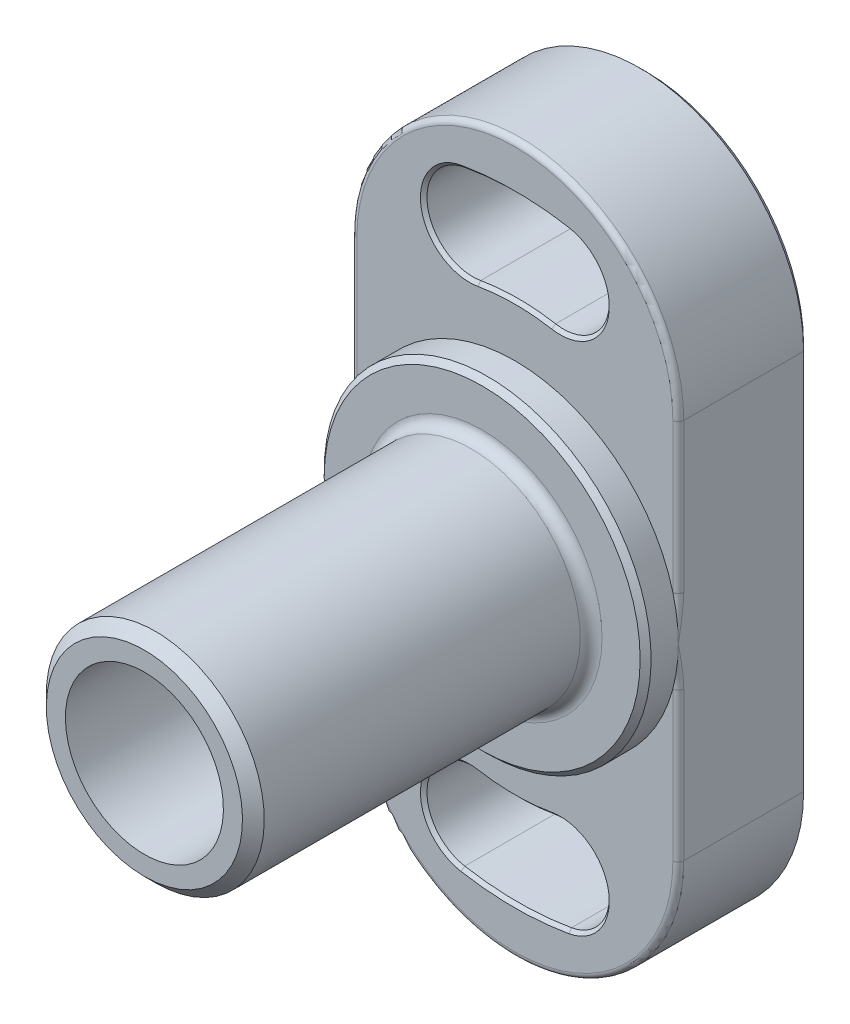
ISO-10303-21;
HEADER;
FILE_DESCRIPTION(('STEP AP214'),'2;1');
FILE_NAME('part.step','',(''),(''),'','','');
FILE_SCHEMA(('AUTOMOTIVE_DESIGN { 1 0 10303 214 1 1 1 1 }'));
ENDSEC;
DATA;
#1=APPLICATION_CONTEXT('core data for automotive mechanical design processes');
#2=APPLICATION_PROTOCOL_DEFINITION('international standard','automotive_design',2000,#1);
#3=PRODUCT_CONTEXT('',#1,'mechanical');
#4=PRODUCT('Part','Part','',(#3));
#5=PRODUCT_RELATED_PRODUCT_CATEGORY('part','',(#4));
#6=PRODUCT_DEFINITION_FORMATION('','',#4);
#7=PRODUCT_DEFINITION_CONTEXT('part definition',#1,'design');
#8=PRODUCT_DEFINITION('design','',#6,#7);
#9=PRODUCT_DEFINITION_SHAPE('','',#8);
#10=(LENGTH_UNIT() NAMED_UNIT(*) SI_UNIT(.MILLI.,.METRE.));
#11=(NAMED_UNIT(*) PLANE_ANGLE_UNIT() SI_UNIT($,.RADIAN.));
#12=(NAMED_UNIT(*) SI_UNIT($,.STERADIAN.) SOLID_ANGLE_UNIT());
#13=UNCERTAINTY_MEASURE_WITH_UNIT(LENGTH_MEASURE(1.E-05),#10,'distance_accuracy_value','');
#14=(GEOMETRIC_REPRESENTATION_CONTEXT(3) GLOBAL_UNCERTAINTY_ASSIGNED_CONTEXT((#13)) GLOBAL_UNIT_ASSIGNED_CONTEXT((#10,
#11,#12)) REPRESENTATION_CONTEXT('',''));
#15=CARTESIAN_POINT('',(0.,0.,0.));
#16=DIRECTION('',(0.,0.,1.));
#17=DIRECTION('',(1.,0.,0.));
#18=AXIS2_PLACEMENT_3D('',#15,#16,#17);
#19=CARTESIAN_POINT('',(0.,17.5,12.));
#20=DIRECTION('',(0.,0.,1.));
#21=DIRECTION('',(0.,-1.,0.));
#22=AXIS2_PLACEMENT_3D('',#19,#20,#21);
#23=PLANE('',#22);
#24=CARTESIAN_POINT('',(-4.16755626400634,23.635386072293,12.));
#25=DIRECTION('',(0.,0.,1.));
#26=DIRECTION('',(0.,-1.,0.));
#27=AXIS2_PLACEMENT_3D('',#24,#25,#26);
#28=CIRCLE('',#27,4.5);
#29=CARTESIAN_POINT('',(-3.38613946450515,19.203751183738,12.));
#30=VERTEX_POINT('',#29);
#31=CARTESIAN_POINT('',(-4.94897306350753,28.067020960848,12.));
#32=VERTEX_POINT('',#31);
#33=EDGE_CURVE('E1114',#30,#32,#28,.F.);
#34=ORIENTED_EDGE('',*,*,#33,.T.);
#35=CARTESIAN_POINT('',(0.,0.,12.));
#36=DIRECTION('',(0.,0.,1.));
#37=DIRECTION('',(0.,-1.,0.));
#38=AXIS2_PLACEMENT_3D('',#35,#36,#37);
#39=CIRCLE('',#38,28.5);
#40=CARTESIAN_POINT('',(4.94897306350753,28.067020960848,12.));
#41=VERTEX_POINT('',#40);
#42=EDGE_CURVE('E1116',#32,#41,#39,.F.);
#43=ORIENTED_EDGE('',*,*,#42,.T.);
#44=CARTESIAN_POINT('',(4.16755626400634,23.635386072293,12.));
#45=DIRECTION('',(0.,0.,1.));
#46=DIRECTION('',(0.,-1.,0.));
#47=AXIS2_PLACEMENT_3D('',#44,#45,#46);
#48=CIRCLE('',#47,4.5);
#49=CARTESIAN_POINT('',(3.38613946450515,19.203751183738,12.));
#50=VERTEX_POINT('',#49);
#51=EDGE_CURVE('E1112',#41,#50,#48,.F.);
#52=ORIENTED_EDGE('',*,*,#51,.T.);
#53=CARTESIAN_POINT('',(0.,0.,12.));
#54=DIRECTION('',(0.,0.,1.));
#55=DIRECTION('',(0.,-1.,0.));
#56=AXIS2_PLACEMENT_3D('',#53,#54,#55);
#57=CIRCLE('',#56,19.5);
#58=EDGE_CURVE('E1110',#50,#30,#57,.T.);
#59=ORIENTED_EDGE('',*,*,#58,.T.);
#60=EDGE_LOOP('',(#34,#43,#52,#59));
#61=FACE_BOUND('',#60,.T.);
#62=CARTESIAN_POINT('',(0.,0.,12.));
#63=DIRECTION('',(0.,0.,-1.));
#64=DIRECTION('',(0.,1.,0.));
#65=AXIS2_PLACEMENT_3D('',#62,#63,#64);
#66=CIRCLE('',#65,15.);
#67=CARTESIAN_POINT('',(-14.5,3.8405728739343,12.));
#68=VERTEX_POINT('',#67);
#69=CARTESIAN_POINT('',(14.5,3.8405728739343,12.));
#70=VERTEX_POINT('',#69);
#71=EDGE_CURVE('E242',#68,#70,#66,.T.);
#72=ORIENTED_EDGE('',*,*,#71,.T.);
#73=DIRECTION('',(0.,1.,0.));
#74=VECTOR('',#73,1.);
#75=CARTESIAN_POINT('',(14.5,17.5,12.));
#76=LINE('',#75,#74);
#77=CARTESIAN_POINT('',(14.5,17.5,12.));
#78=VERTEX_POINT('',#77);
#79=EDGE_CURVE('E248',#70,#78,#76,.T.);
#80=ORIENTED_EDGE('',*,*,#79,.T.);
#81=CARTESIAN_POINT('',(0.,17.5,12.));
#82=DIRECTION('',(0.,0.,1.));
#83=DIRECTION('',(0.,-1.,0.));
#84=AXIS2_PLACEMENT_3D('',#81,#82,#83);
#85=CIRCLE('',#84,14.5);
#86=CARTESIAN_POINT('',(-14.5,17.5,12.));
#87=VERTEX_POINT('',#86);
#88=EDGE_CURVE('E532',#78,#87,#85,.T.);
#89=ORIENTED_EDGE('',*,*,#88,.T.);
#90=DIRECTION('',(0.,-1.,0.));
#91=VECTOR('',#90,1.);
#92=CARTESIAN_POINT('',(-14.5,0.,12.));
#93=LINE('',#92,#91);
#94=EDGE_CURVE('E524',#87,#68,#93,.T.);
#95=ORIENTED_EDGE('',*,*,#94,.T.);
#96=EDGE_LOOP('',(#72,#80,#89,#95));
#97=FACE_BOUND('',#96,.T.);
#98=ADVANCED_FACE('F14',(#61,#97),#23,.T.);
#99=CARTESIAN_POINT('',(4.16755626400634,-23.635386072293,12.));
#100=DIRECTION('',(0.,0.,1.));
#101=DIRECTION('',(0.,-1.,0.));
#102=AXIS2_PLACEMENT_3D('',#99,#100,#101);
#103=CIRCLE('',#102,4.5);
#104=CARTESIAN_POINT('',(3.38613946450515,-19.203751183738,12.));
#105=VERTEX_POINT('',#104);
#106=CARTESIAN_POINT('',(4.94897306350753,-28.067020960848,12.));
#107=VERTEX_POINT('',#106);
#108=EDGE_CURVE('E1140',#105,#107,#103,.F.);
#109=ORIENTED_EDGE('',*,*,#108,.T.);
#110=CARTESIAN_POINT('',(0.,0.,12.));
#111=DIRECTION('',(0.,0.,1.));
#112=DIRECTION('',(0.,-1.,0.));
#113=AXIS2_PLACEMENT_3D('',#110,#111,#112);
#114=CIRCLE('',#113,28.5);
#115=CARTESIAN_POINT('',(-4.94897306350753,-28.067020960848,12.));
#116=VERTEX_POINT('',#115);
#117=EDGE_CURVE('E1142',#107,#116,#114,.F.);
#118=ORIENTED_EDGE('',*,*,#117,.T.);
#119=CARTESIAN_POINT('',(-4.16755626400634,-23.635386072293,12.));
#120=DIRECTION('',(0.,0.,1.));
#121=DIRECTION('',(0.,-1.,0.));
#122=AXIS2_PLACEMENT_3D('',#119,#120,#121);
#123=CIRCLE('',#122,4.5);
#124=CARTESIAN_POINT('',(-3.38613946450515,-19.203751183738,12.));
#125=VERTEX_POINT('',#124);
#126=EDGE_CURVE('E1138',#116,#125,#123,.F.);
#127=ORIENTED_EDGE('',*,*,#126,.T.);
#128=CARTESIAN_POINT('',(0.,0.,12.));
#129=DIRECTION('',(0.,0.,1.));
#130=DIRECTION('',(0.,-1.,0.));
#131=AXIS2_PLACEMENT_3D('',#128,#129,#130);
#132=CIRCLE('',#131,19.5);
#133=EDGE_CURVE('E1136',#125,#105,#132,.T.);
#134=ORIENTED_EDGE('',*,*,#133,.T.);
#135=EDGE_LOOP('',(#109,#118,#127,#134));
#136=FACE_BOUND('',#135,.T.);
#137=CARTESIAN_POINT('',(0.,-17.5,12.));
#138=DIRECTION('',(0.,0.,1.));
#139=DIRECTION('',(0.,-1.,0.));
#140=AXIS2_PLACEMENT_3D('',#137,#138,#139);
#141=CIRCLE('',#140,14.5);
#142=CARTESIAN_POINT('',(-14.5,-17.5,12.));
#143=VERTEX_POINT('',#142);
#144=CARTESIAN_POINT('',(14.5,-17.5,12.));
#145=VERTEX_POINT('',#144);
#146=EDGE_CURVE('E564',#143,#145,#141,.T.);
#147=ORIENTED_EDGE('',*,*,#146,.T.);
#148=DIRECTION('',(0.,1.,0.));
#149=VECTOR('',#148,1.);
#150=CARTESIAN_POINT('',(14.5,0.,12.));
#151=LINE('',#150,#149);
#152=CARTESIAN_POINT('',(14.5,-3.8405728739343,12.));
#153=VERTEX_POINT('',#152);
#154=EDGE_CURVE('E562',#145,#153,#151,.T.);
#155=ORIENTED_EDGE('',*,*,#154,.T.);
#156=CARTESIAN_POINT('',(-14.5,-3.8405728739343,12.));
#157=VERTEX_POINT('',#156);
#158=EDGE_CURVE('E231',#153,#157,#66,.T.);
#159=ORIENTED_EDGE('',*,*,#158,.T.);
#160=DIRECTION('',(0.,-1.,0.));
#161=VECTOR('',#160,1.);
#162=CARTESIAN_POINT('',(-14.5,-17.5,12.));
#163=LINE('',#162,#161);
#164=EDGE_CURVE('E566',#157,#143,#163,.T.);
#165=ORIENTED_EDGE('',*,*,#164,.T.);
#166=EDGE_LOOP('',(#147,#155,#159,#165));
#167=FACE_BOUND('',#166,.T.);
#168=ADVANCED_FACE('F431',(#136,#167),#23,.T.);
#169=CARTESIAN_POINT('',(0.,17.5,0.));
#170=DIRECTION('',(0.,0.,1.));
#171=DIRECTION('',(0.,-1.,0.));
#172=AXIS2_PLACEMENT_3D('',#169,#170,#171);
#173=PLANE('',#172);
#174=CARTESIAN_POINT('',(4.16755626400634,23.635386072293,0.));
#175=DIRECTION('',(0.,0.,1.));
#176=DIRECTION('',(0.,-1.,0.));
#177=AXIS2_PLACEMENT_3D('',#174,#175,#176);
#178=CIRCLE('',#177,4.5);
#179=CARTESIAN_POINT('',(3.38613946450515,19.203751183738,0.));
#180=VERTEX_POINT('',#179);
#181=CARTESIAN_POINT('',(4.94897306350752,28.067020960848,0.));
#182=VERTEX_POINT('',#181);
#183=EDGE_CURVE('E37',#180,#182,#178,.T.);
#184=ORIENTED_EDGE('',*,*,#183,.T.);
#185=CARTESIAN_POINT('',(0.,0.,0.));
#186=DIRECTION('',(0.,0.,1.));
#187=DIRECTION('',(0.,-1.,0.));
#188=AXIS2_PLACEMENT_3D('',#185,#186,#187);
#189=CIRCLE('',#188,28.5);
#190=CARTESIAN_POINT('',(-4.94897306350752,28.067020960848,0.));
#191=VERTEX_POINT('',#190);
#192=EDGE_CURVE('E670',#182,#191,#189,.T.);
#193=ORIENTED_EDGE('',*,*,#192,.T.);
#194=CARTESIAN_POINT('',(-4.16755626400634,23.635386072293,0.));
#195=DIRECTION('',(0.,0.,1.));
#196=DIRECTION('',(0.,-1.,0.));
#197=AXIS2_PLACEMENT_3D('',#194,#195,#196);
#198=CIRCLE('',#197,4.5);
#199=CARTESIAN_POINT('',(-3.38613946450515,19.203751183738,0.));
#200=VERTEX_POINT('',#199);
#201=EDGE_CURVE('E643',#191,#200,#198,.T.);
#202=ORIENTED_EDGE('',*,*,#201,.T.);
#203=CARTESIAN_POINT('',(0.,0.,0.));
#204=DIRECTION('',(0.,0.,1.));
#205=DIRECTION('',(0.,-1.,0.));
#206=AXIS2_PLACEMENT_3D('',#203,#204,#205);
#207=CIRCLE('',#206,19.5);
#208=EDGE_CURVE('E1164',#200,#180,#207,.F.);
#209=ORIENTED_EDGE('',*,*,#208,.T.);
#210=EDGE_LOOP('',(#184,#193,#202,#209));
#211=FACE_BOUND('',#210,.T.);
#212=CARTESIAN_POINT('',(-4.16755626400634,-23.635386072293,0.));
#213=DIRECTION('',(0.,0.,1.));
#214=DIRECTION('',(0.,-1.,0.));
#215=AXIS2_PLACEMENT_3D('',#212,#213,#214);
#216=CIRCLE('',#215,4.5);
#217=CARTESIAN_POINT('',(-3.38613946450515,-19.203751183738,0.));
#218=VERTEX_POINT('',#217);
#219=CARTESIAN_POINT('',(-4.94897306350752,-28.067020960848,0.));
#220=VERTEX_POINT('',#219);
#221=EDGE_CURVE('E1073',#218,#220,#216,.T.);
#222=ORIENTED_EDGE('',*,*,#221,.T.);
#223=CARTESIAN_POINT('',(0.,0.,0.));
#224=DIRECTION('',(0.,0.,1.));
#225=DIRECTION('',(0.,-1.,0.));
#226=AXIS2_PLACEMENT_3D('',#223,#224,#225);
#227=CIRCLE('',#226,28.5);
#228=CARTESIAN_POINT('',(4.94897306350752,-28.067020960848,0.));
#229=VERTEX_POINT('',#228);
#230=EDGE_CURVE('E1162',#220,#229,#227,.T.);
#231=ORIENTED_EDGE('',*,*,#230,.T.);
#232=CARTESIAN_POINT('',(4.16755626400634,-23.635386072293,0.));
#233=DIRECTION('',(0.,0.,1.));
#234=DIRECTION('',(0.,-1.,0.));
#235=AXIS2_PLACEMENT_3D('',#232,#233,#234);
#236=CIRCLE('',#235,4.5);
#237=CARTESIAN_POINT('',(3.38613946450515,-19.203751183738,0.));
#238=VERTEX_POINT('',#237);
#239=EDGE_CURVE('E1160',#229,#238,#236,.T.);
#240=ORIENTED_EDGE('',*,*,#239,.T.);
#241=CARTESIAN_POINT('',(0.,0.,0.));
#242=DIRECTION('',(0.,0.,1.));
#243=DIRECTION('',(0.,-1.,0.));
#244=AXIS2_PLACEMENT_3D('',#241,#242,#243);
#245=CIRCLE('',#244,19.5);
#246=EDGE_CURVE('E1157',#238,#218,#245,.F.);
#247=ORIENTED_EDGE('',*,*,#246,.T.);
#248=EDGE_LOOP('',(#222,#231,#240,#247));
#249=FACE_BOUND('',#248,.T.);
#250=CARTESIAN_POINT('',(0.,17.5,0.));
#251=DIRECTION('',(0.,0.,1.));
#252=DIRECTION('',(0.,-1.,0.));
#253=AXIS2_PLACEMENT_3D('',#250,#251,#252);
#254=CIRCLE('',#253,14.5);
#255=CARTESIAN_POINT('',(-14.5,17.5,0.));
#256=VERTEX_POINT('',#255);
#257=CARTESIAN_POINT('',(14.5,17.5,0.));
#258=VERTEX_POINT('',#257);
#259=EDGE_CURVE('E1078',#256,#258,#254,.F.);
#260=ORIENTED_EDGE('',*,*,#259,.T.);
#261=DIRECTION('',(0.,-1.,0.));
#262=VECTOR('',#261,1.);
#263=CARTESIAN_POINT('',(14.5,17.5,0.));
#264=LINE('',#263,#262);
#265=CARTESIAN_POINT('',(14.5,-17.5,0.));
#266=VERTEX_POINT('',#265);
#267=EDGE_CURVE('E1082',#258,#266,#264,.T.);
#268=ORIENTED_EDGE('',*,*,#267,.T.);
#269=CARTESIAN_POINT('',(0.,-17.5,0.));
#270=DIRECTION('',(0.,0.,1.));
#271=DIRECTION('',(0.,-1.,0.));
#272=AXIS2_PLACEMENT_3D('',#269,#270,#271);
#273=CIRCLE('',#272,14.5);
#274=CARTESIAN_POINT('',(-14.5,-17.5,0.));
#275=VERTEX_POINT('',#274);
#276=EDGE_CURVE('E1087',#266,#275,#273,.F.);
#277=ORIENTED_EDGE('',*,*,#276,.T.);
#278=DIRECTION('',(0.,1.,0.));
#279=VECTOR('',#278,1.);
#280=CARTESIAN_POINT('',(-14.5,17.5,0.));
#281=LINE('',#280,#279);
#282=EDGE_CURVE('E538',#275,#256,#281,.T.);
#283=ORIENTED_EDGE('',*,*,#282,.T.);
#284=EDGE_LOOP('',(#260,#268,#277,#283));
#285=FACE_BOUND('',#284,.T.);
#286=CARTESIAN_POINT('',(0.,0.,0.));
#287=DIRECTION('',(0.,0.,-1.));
#288=DIRECTION('',(0.,1.,0.));
#289=AXIS2_PLACEMENT_3D('',#286,#287,#288);
#290=CIRCLE('',#289,5.25);
#291=CARTESIAN_POINT('',(0.,5.25,0.));
#292=VERTEX_POINT('',#291);
#293=EDGE_CURVE('E235',#292,#292,#290,.T.);
#294=ORIENTED_EDGE('',*,*,#293,.F.);
#295=EDGE_LOOP('',(#294));
#296=FACE_BOUND('',#295,.T.);
#297=ADVANCED_FACE('F272',(#211,#249,#285,#296),#173,.F.);
#298=CARTESIAN_POINT('',(0.,17.5,12.));
#299=DIRECTION('',(0.,0.,-1.));
#300=DIRECTION('',(0.,1.,0.));
#301=AXIS2_PLACEMENT_3D('',#298,#299,#300);
#302=CYLINDRICAL_SURFACE('',#301,15.);
#303=DIRECTION('',(0.,0.,-1.));
#304=VECTOR('',#303,1.);
#305=CARTESIAN_POINT('',(15.,17.5,12.));
#306=LINE('',#305,#304);
#307=CARTESIAN_POINT('',(15.,17.5,11.5));
#308=VERTEX_POINT('',#307);
#309=CARTESIAN_POINT('',(15.,17.5,0.499999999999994));
#310=VERTEX_POINT('',#309);
#311=EDGE_CURVE('E576',#308,#310,#306,.T.);
#312=ORIENTED_EDGE('',*,*,#311,.T.);
#313=CARTESIAN_POINT('',(0.,17.5,0.499999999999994));
#314=DIRECTION('',(0.,0.,1.));
#315=DIRECTION('',(0.,-1.,0.));
#316=AXIS2_PLACEMENT_3D('',#313,#314,#315);
#317=CIRCLE('',#316,15.);
#318=CARTESIAN_POINT('',(-15.,17.5,0.499999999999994));
#319=VERTEX_POINT('',#318);
#320=EDGE_CURVE('E1094',#310,#319,#317,.T.);
#321=ORIENTED_EDGE('',*,*,#320,.T.);
#322=DIRECTION('',(0.,0.,-1.));
#323=VECTOR('',#322,1.);
#324=CARTESIAN_POINT('',(-15.,17.5,12.));
#325=LINE('',#324,#323);
#326=CARTESIAN_POINT('',(-15.,17.5,11.5));
#327=VERTEX_POINT('',#326);
#328=EDGE_CURVE('E578',#327,#319,#325,.T.);
#329=ORIENTED_EDGE('',*,*,#328,.F.);
#330=CARTESIAN_POINT('',(0.,17.5,11.5));
#331=DIRECTION('',(0.,0.,1.));
#332=DIRECTION('',(0.,-1.,0.));
#333=AXIS2_PLACEMENT_3D('',#330,#331,#332);
#334=CIRCLE('',#333,15.);
#335=EDGE_CURVE('E491',#327,#308,#334,.F.);
#336=ORIENTED_EDGE('',*,*,#335,.T.);
#337=EDGE_LOOP('',(#312,#321,#329,#336));
#338=FACE_BOUND('',#337,.T.);
#339=ADVANCED_FACE('F765',(#338),#302,.T.);
#340=CARTESIAN_POINT('',(-15.,17.5,12.));
#341=DIRECTION('',(1.,0.,0.));
#342=DIRECTION('',(0.,1.,0.));
#343=AXIS2_PLACEMENT_3D('',#340,#341,#342);
#344=PLANE('',#343);
#345=ORIENTED_EDGE('',*,*,#328,.T.);
#346=DIRECTION('',(0.,-1.,0.));
#347=VECTOR('',#346,1.);
#348=CARTESIAN_POINT('',(-15.,17.5,0.499999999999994));
#349=LINE('',#348,#347);
#350=CARTESIAN_POINT('',(-15.,-17.5,0.499999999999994));
#351=VERTEX_POINT('',#350);
#352=EDGE_CURVE('E638',#319,#351,#349,.T.);
#353=ORIENTED_EDGE('',*,*,#352,.T.);
#354=DIRECTION('',(0.,0.,-1.));
#355=VECTOR('',#354,1.);
#356=CARTESIAN_POINT('',(-15.,-17.5,12.));
#357=LINE('',#356,#355);
#358=CARTESIAN_POINT('',(-15.,-17.5,11.5));
#359=VERTEX_POINT('',#358);
#360=EDGE_CURVE('E575',#359,#351,#357,.T.);
#361=ORIENTED_EDGE('',*,*,#360,.F.);
#362=DIRECTION('',(0.,-1.,0.));
#363=VECTOR('',#362,1.);
#364=CARTESIAN_POINT('',(-15.,0.,11.5));
#365=LINE('',#364,#363);
#366=CARTESIAN_POINT('',(-15.,-3.84057287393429,11.5));
#367=VERTEX_POINT('',#366);
#368=EDGE_CURVE('E536',#359,#367,#365,.F.);
#369=ORIENTED_EDGE('',*,*,#368,.T.);
#370=CARTESIAN_POINT('',(-14.1856737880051,-4.87510606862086,12.));
#371=CARTESIAN_POINT('',(-14.4308988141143,-4.8200365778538,12.1904278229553));
#372=CARTESIAN_POINT('',(-14.7154494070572,-4.85778299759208,12.0599024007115));
#373=CARTESIAN_POINT('',(-15.,-4.89552941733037,11.9293769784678));
#374=CARTESIAN_POINT('',(-15.,-4.98312868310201,11.6264626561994));
#375=CARTESIAN_POINT('',(-14.1999027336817,-4.83370691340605,12.));
#376=CARTESIAN_POINT('',(-14.4472952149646,-4.78697960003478,12.179296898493));
#377=CARTESIAN_POINT('',(-14.7236897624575,-4.8220275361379,12.0454610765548));
#378=CARTESIAN_POINT('',(-15.,-4.85749879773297,11.9117765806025));
#379=CARTESIAN_POINT('',(-15.,-4.9358126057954,11.6128365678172));
#380=CARTESIAN_POINT('',(-14.2141201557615,-4.79174292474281,12.));
#381=CARTESIAN_POINT('',(-14.4628891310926,-4.75158482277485,12.168348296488));
#382=CARTESIAN_POINT('',(-14.7314806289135,-4.78429589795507,12.0318535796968));
#383=CARTESIAN_POINT('',(-15.,-4.81740548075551,11.8954843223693));
#384=CARTESIAN_POINT('',(-15.,-4.88806808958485,11.6008401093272));
#385=CARTESIAN_POINT('',(-14.2424242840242,-4.70694533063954,12.));
#386=CARTESIAN_POINT('',(-14.4925191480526,-4.67765986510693,12.1471868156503));
#387=CARTESIAN_POINT('',(-14.7462977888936,-4.7059552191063,12.0062663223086));
#388=CARTESIAN_POINT('',(-15.,-4.73463769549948,11.8654769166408));
#389=CARTESIAN_POINT('',(-15.,-4.79202360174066,11.5795570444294));
#390=CARTESIAN_POINT('',(-14.25651110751,-4.66411264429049,12.));
#391=CARTESIAN_POINT('',(-14.5065891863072,-4.63912168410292,12.1369538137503));
#392=CARTESIAN_POINT('',(-14.7533248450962,-4.66534911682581,11.994284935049));
#393=CARTESIAN_POINT('',(-15.,-4.69194412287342,11.8517164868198));
#394=CARTESIAN_POINT('',(-15.,-4.74372423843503,11.57026771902));
#395=CARTESIAN_POINT('',(-14.2844323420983,-4.57788643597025,12.));
#396=CARTESIAN_POINT('',(-14.5334302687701,-4.560066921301,12.1174390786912));
#397=CARTESIAN_POINT('',(-14.7667441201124,-4.58238623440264,11.971915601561));
#398=CARTESIAN_POINT('',(-15.,-4.60507035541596,11.8264891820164));
#399=CARTESIAN_POINT('',(-15.,-4.64692445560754,11.5538496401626));
#400=CARTESIAN_POINT('',(-14.2982673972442,-4.53449504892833,12.));
#401=CARTESIAN_POINT('',(-14.5462279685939,-4.51954018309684,12.1081378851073));
#402=CARTESIAN_POINT('',(-14.7731382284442,-4.54003523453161,11.9615228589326));
#403=CARTESIAN_POINT('',(-15.,-4.56087090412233,11.8149846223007));
#404=CARTESIAN_POINT('',(-15.,-4.59842511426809,11.5467143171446));
#405=CARTESIAN_POINT('',(-14.3256841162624,-4.44711949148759,12.));
#406=CARTESIAN_POINT('',(-14.570771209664,-4.43691362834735,12.0904385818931));
#407=CARTESIAN_POINT('',(-14.7854096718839,-4.45394787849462,11.9421401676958));
#408=CARTESIAN_POINT('',(-15.,-4.47131934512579,11.7939175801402));
#409=CARTESIAN_POINT('',(-15.,-4.50118580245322,11.5342294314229));
#410=CARTESIAN_POINT('',(-14.3392657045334,-4.40313515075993,12.));
#411=CARTESIAN_POINT('',(-14.5825339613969,-4.39479436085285,12.0820269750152));
#412=CARTESIAN_POINT('',(-14.7912868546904,-4.41021111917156,11.9331506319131));
#413=CARTESIAN_POINT('',(-15.,-4.42594200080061,11.7843325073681));
#414=CARTESIAN_POINT('',(-15.,-4.45244576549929,11.528880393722));
#415=CARTESIAN_POINT('',(-14.3793254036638,-4.27122821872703,12.));
#416=CARTESIAN_POINT('',(-14.616146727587,-4.26789348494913,12.0583366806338));
#417=CARTESIAN_POINT('',(-14.8081521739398,-4.27829233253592,11.9082386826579));
#418=CARTESIAN_POINT('',(-15.,-4.28991775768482,11.7583744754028));
#419=CARTESIAN_POINT('',(-15.,-4.30689436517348,11.5151876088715));
#420=CARTESIAN_POINT('',(-14.4053721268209,-4.18256948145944,12.));
#421=CARTESIAN_POINT('',(-14.6368699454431,-4.18084594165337,12.0441973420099));
#422=CARTESIAN_POINT('',(-14.8184923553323,-4.18863761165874,11.8941760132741));
#423=CARTESIAN_POINT('',(-15.,-4.19749690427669,11.7442986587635));
#424=CARTESIAN_POINT('',(-15.,-4.20987372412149,11.509060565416));
#425=CARTESIAN_POINT('',(-14.4561333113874,-4.00360812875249,12.));
#426=CARTESIAN_POINT('',(-14.6755394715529,-4.00386221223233,12.0189870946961));
#427=CARTESIAN_POINT('',(-14.8378251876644,-4.00689595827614,11.8701311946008));
#428=CARTESIAN_POINT('',(-15.,-4.01098340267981,11.7214120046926));
#429=CARTESIAN_POINT('',(-15.,-4.01558600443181,11.5013556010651));
#430=CARTESIAN_POINT('',(-14.4808464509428,-3.91330399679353,12.));
#431=CARTESIAN_POINT('',(-14.6935508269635,-3.91379350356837,12.0078604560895));
#432=CARTESIAN_POINT('',(-14.8468165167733,-3.91480674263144,11.8601530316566));
#433=CARTESIAN_POINT('',(-15.,-3.91673656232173,11.7125243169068));
#434=CARTESIAN_POINT('',(-15.,-3.91831877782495,11.4997821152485));
#435=CARTESIAN_POINT('',(-14.5440442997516,-3.67347958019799,12.));
#436=CARTESIAN_POINT('',(-14.7378916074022,-3.6745958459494,11.9821196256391));
#437=CARTESIAN_POINT('',(-14.8690574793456,-3.67002882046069,11.8383146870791));
#438=CARTESIAN_POINT('',(-15.,-3.66790082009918,11.694732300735));
#439=CARTESIAN_POINT('',(-15.,-3.66192628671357,11.5004219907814));
#440=CARTESIAN_POINT('',(-14.5812893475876,-3.52283182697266,12.));
#441=CARTESIAN_POINT('',(-14.7626122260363,-3.52272499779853,11.9695190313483));
#442=CARTESIAN_POINT('',(-14.8813776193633,-3.51605500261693,11.8292949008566));
#443=CARTESIAN_POINT('',(-15.,-3.51134329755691,11.6891467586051));
#444=CARTESIAN_POINT('',(-15.,-3.50281056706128,11.5056809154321));
#445=CARTESIAN_POINT('',(-14.6514491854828,-3.21860703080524,12.));
#446=CARTESIAN_POINT('',(-14.8072920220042,-3.21617499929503,11.9499722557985));
#447=CARTESIAN_POINT('',(-14.9037142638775,-3.20589367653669,11.8180832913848));
#448=CARTESIAN_POINT('',(-15.,-3.19753505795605,11.6862586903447));
#449=CARTESIAN_POINT('',(-15.,-3.18495584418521,11.5232619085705));
#450=CARTESIAN_POINT('',(-14.6843623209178,-3.06502889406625,12.));
#451=CARTESIAN_POINT('',(-14.8273706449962,-3.06110184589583,11.9429309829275));
#452=CARTESIAN_POINT('',(-14.9137298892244,-3.04970534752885,11.8158940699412));
#453=CARTESIAN_POINT('',(-15.,-3.03985484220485,11.6888527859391));
#454=CARTESIAN_POINT('',(-15.,-3.02621700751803,11.5355866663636));
#455=CARTESIAN_POINT('',(-14.7456026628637,-2.75538011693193,12.));
#456=CARTESIAN_POINT('',(-14.8635844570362,-2.74912309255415,11.9332924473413));
#457=CARTESIAN_POINT('',(-14.9318364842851,-2.73595159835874,11.8167708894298));
#458=CARTESIAN_POINT('',(-15.,-2.72431238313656,11.7002450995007));
#459=CARTESIAN_POINT('',(-15.,-2.70915717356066,11.5655812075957));
#460=CARTESIAN_POINT('',(-14.773927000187,-2.5993079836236,12.));
#461=CARTESIAN_POINT('',(-14.8797958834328,-2.59188688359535,11.9306439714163));
#462=CARTESIAN_POINT('',(-14.939926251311,-2.57838538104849,11.819840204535));
#463=CARTESIAN_POINT('',(-15.,-2.56610052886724,11.7089994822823));
#464=CARTESIAN_POINT('',(-15.,-2.55083649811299,11.5832543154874));
#465=CARTESIAN_POINT('',(-14.8257645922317,-2.2851835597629,12.));
#466=CARTESIAN_POINT('',(-14.9087752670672,-2.27629701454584,11.9288211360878));
#467=CARTESIAN_POINT('',(-14.9544147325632,-2.26247177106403,11.8300229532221));
#468=CARTESIAN_POINT('',(-15.,-2.24984605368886,11.7311838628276));
#469=CARTESIAN_POINT('',(-15.,-2.2346949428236,11.6226569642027));
#470=CARTESIAN_POINT('',(-14.8492773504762,-2.12713106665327,12.));
#471=CARTESIAN_POINT('',(-14.9215959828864,-2.11765812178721,11.9296190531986));
#472=CARTESIAN_POINT('',(-14.9608132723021,-2.10412429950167,11.8371368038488));
#473=CARTESIAN_POINT('',(-15.,-2.09150794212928,11.7445994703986));
#474=CARTESIAN_POINT('',(-15.,-2.07687411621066,11.6443869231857));
#475=CARTESIAN_POINT('',(-14.9126243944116,-1.648508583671,12.));
#476=CARTESIAN_POINT('',(-14.9554554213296,-1.64005426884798,11.9359836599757));
#477=CARTESIAN_POINT('',(-14.9777963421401,-1.62629223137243,11.8631339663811));
#478=CARTESIAN_POINT('',(-15.,-1.61627727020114,11.7900907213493));
#479=CARTESIAN_POINT('',(-15.,-1.60199575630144,11.7143989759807));
#480=CARTESIAN_POINT('',(-14.944855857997,-1.32553957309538,12.));
#481=CARTESIAN_POINT('',(-14.9720715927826,-1.31713375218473,11.9455352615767));
#482=CARTESIAN_POINT('',(-14.9860529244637,-1.30611016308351,11.8866390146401));
#483=CARTESIAN_POINT('',(-15.,-1.29690527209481,11.8276060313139));
#484=CARTESIAN_POINT('',(-15.,-1.28562567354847,11.767275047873));
#485=CARTESIAN_POINT('',(-14.9882629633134,-0.676558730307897,12.));
#486=CARTESIAN_POINT('',(-14.9941421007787,-0.671823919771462,11.9696596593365));
#487=CARTESIAN_POINT('',(-14.9970846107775,-0.66531721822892,11.9393427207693));
#488=CARTESIAN_POINT('',(-15.,-0.660555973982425,11.9088694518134));
#489=CARTESIAN_POINT('',(-15.,-0.65406030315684,11.878614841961));
#490=CARTESIAN_POINT('',(-14.9994473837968,-0.350548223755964,12.));
#491=CARTESIAN_POINT('',(-14.9997238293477,-0.347649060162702,11.9842692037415));
#492=CARTESIAN_POINT('',(-14.9998620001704,-0.344706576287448,11.9685389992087));
#493=CARTESIAN_POINT('',(-15.,-0.341806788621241,11.9528049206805));
#494=CARTESIAN_POINT('',(-15.,-0.338864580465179,11.9370762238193));
#495=CARTESIAN_POINT('',(-14.9999866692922,-0.0204121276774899,12.));
#496=CARTESIAN_POINT('',(-14.99999333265,-0.0202420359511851,11.9990839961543));
#497=CARTESIAN_POINT('',(-14.9999966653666,-0.0200719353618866,11.9981679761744));
#498=CARTESIAN_POINT('',(-15.,-0.0199018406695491,11.9972519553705));
#499=CARTESIAN_POINT('',(-15.,-0.0197317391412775,11.9963359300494));
#500=CARTESIAN_POINT('',(-14.9999916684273,-0.0163293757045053,12.));
#501=CARTESIAN_POINT('',(-14.9999958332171,-0.0161933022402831,11.9992672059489));
#502=CARTESIAN_POINT('',(-14.9999979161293,-0.0160572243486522,11.9985344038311));
#503=CARTESIAN_POINT('',(-15.,-0.015921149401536,11.9978016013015));
#504=CARTESIAN_POINT('',(-15.,-0.0157850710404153,11.9970687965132));
#505=CARTESIAN_POINT('',(-14.9999983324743,-0.00816441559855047,12.));
#506=CARTESIAN_POINT('',(-14.9999991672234,-0.00809638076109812,11.9996336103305));
#507=CARTESIAN_POINT('',(-14.9999995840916,-0.00802834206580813,11.9992672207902));
#508=CARTESIAN_POINT('',(-15.,-0.00796030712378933,11.9989008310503));
#509=CARTESIAN_POINT('',(-15.,-0.0078922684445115,11.9985344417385));
#510=CARTESIAN_POINT('',(-14.9999999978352,-0.0040822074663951,12.));
#511=CARTESIAN_POINT('',(-15.0000000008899,-0.00404818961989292,11.9998168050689));
#512=CARTESIAN_POINT('',(-15.0000000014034,-0.00401417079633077,11.9996336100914));
#513=CARTESIAN_POINT('',(-15.,-0.00398015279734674,11.9994504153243));
#514=CARTESIAN_POINT('',(-15.,-0.00394613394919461,11.9992672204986));
#515=CARTESIAN_POINT('',(-15.,0.,12.));
#516=CARTESIAN_POINT('',(-15.,0.,12.));
#517=CARTESIAN_POINT('',(-15.,0.,12.));
#518=CARTESIAN_POINT('',(-15.,0.,12.));
#519=CARTESIAN_POINT('',(-15.,0.,12.));
#520=(BOUNDED_SURFACE() B_SPLINE_SURFACE(3,2,((#370,#371,#372,#373,#374),(#375,#376,#377,#378,
#379),(#380,#381,#382,#383,#384),(#385,#386,#387,#388,#389),(#390,#391,#392,#393,#394),(#395,
#396,#397,#398,#399),(#400,#401,#402,#403,#404),(#405,#406,#407,#408,#409),(#410,#411,#412,#413,
#414),(#415,#416,#417,#418,#419),(#420,#421,#422,#423,#424),(#425,#426,#427,#428,#429),(#430,
#431,#432,#433,#434),(#435,#436,#437,#438,#439),(#440,#441,#442,#443,#444),(#445,#446,#447,#448,
#449),(#450,#451,#452,#453,#454),(#455,#456,#457,#458,#459),(#460,#461,#462,#463,#464),(#465,
#466,#467,#468,#469),(#470,#471,#472,#473,#474),(#475,#476,#477,#478,#479),(#480,#481,#482,#483,
#484),(#485,#486,#487,#488,#489),(#490,#491,#492,#493,#494),(#495,#496,#497,#498,#499),(#500,
#501,#502,#503,#504),(#505,#506,#507,#508,#509),(#510,#511,#512,#513,#514),(#515,#516,#517,#518,
#519)),.UNSPECIFIED.,.F.,.F.,.F.) B_SPLINE_SURFACE_WITH_KNOTS((4,2,2,2,2,2,2,2,2,2,2,2,2,2,4),
(3,2,3),(0.,0.14763163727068,0.295114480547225,0.442142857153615,0.58921440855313,
0.880696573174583,1.17246254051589,1.64982491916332,2.12736910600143,2.60521073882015,
3.08310165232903,4.0452252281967,5.00694741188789,5.01898981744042,5.0310306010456),(0.,0.5,1.),
.UNSPECIFIED.) GEOMETRIC_REPRESENTATION_ITEM() RATIONAL_B_SPLINE_SURFACE(((1.,0.845842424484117,
1.,0.845842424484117,1.),(1.,0.850711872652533,1.,0.850711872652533,1.),(1.,0.855276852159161,
1.,0.855276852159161,1.),(1.,0.863896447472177,1.,0.863896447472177,1.),(1.,0.867951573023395,
1.,0.867951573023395,1.),(1.,0.875647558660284,1.,0.875647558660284,1.),(1.,0.879289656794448,
1.,0.879289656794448,1.),(1.,0.886240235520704,1.,0.886240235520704,1.),(1.,0.88954861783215,1.,
0.88954861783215,1.),(1.,0.89899492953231,1.,0.89899492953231,1.),(1.,0.904721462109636,1.,
0.904721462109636,1.),(1.,0.915343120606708,1.,0.915343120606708,1.),(1.,0.920237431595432,1.,
0.920237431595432,1.),(1.,0.932262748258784,1.,0.932262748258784,1.),(1.,0.938836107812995,1.,
0.938836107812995,1.),(1.,0.950656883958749,1.,0.950656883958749,1.),(1.,0.955903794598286,1.,
0.955903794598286,1.),(1.,0.965328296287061,1.,0.965328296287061,1.),(1.,0.969505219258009,1.,
0.969505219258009,1.),(1.,0.976948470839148,1.,0.976948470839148,1.),(1.,0.980214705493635,1.,
0.980214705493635,1.),(1.,0.988853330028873,1.,0.988853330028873,1.),(1.,0.993006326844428,1.,
0.993006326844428,1.),(1.,0.998544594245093,1.,0.998544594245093,1.),(1.,0.999931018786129,1.,
0.999931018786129,1.),(1.,0.999998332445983,1.,0.999998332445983,1.),(1.,0.999998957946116,1.,
0.999998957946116,1.),(1.,0.999999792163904,1.,0.999999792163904,1.),(1.,1.00000000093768,1.,
1.00000000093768,1.),(1.,1.,1.,1.,1.))) REPRESENTATION_ITEM('') SURFACE());
#521=CARTESIAN_POINT('',(-15.,-4.98312868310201,11.6264626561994));
#522=CARTESIAN_POINT('',(-15.,-4.9358126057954,11.6128365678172));
#523=CARTESIAN_POINT('',(-15.,-4.88806808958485,11.6008401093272));
#524=CARTESIAN_POINT('',(-15.,-4.79202360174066,11.5795570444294));
#525=CARTESIAN_POINT('',(-15.,-4.74372423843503,11.57026771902));
#526=CARTESIAN_POINT('',(-15.,-4.64692445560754,11.5538496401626));
#527=CARTESIAN_POINT('',(-15.,-4.59842511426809,11.5467143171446));
#528=CARTESIAN_POINT('',(-15.,-4.50118580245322,11.5342294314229));
#529=CARTESIAN_POINT('',(-15.,-4.45244576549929,11.528880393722));
#530=CARTESIAN_POINT('',(-15.,-4.30689436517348,11.5151876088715));
#531=CARTESIAN_POINT('',(-15.,-4.20987372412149,11.509060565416));
#532=CARTESIAN_POINT('',(-15.,-4.01558600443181,11.5013556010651));
#533=CARTESIAN_POINT('',(-15.,-3.91831877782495,11.4997821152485));
#534=CARTESIAN_POINT('',(-15.,-3.66192628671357,11.5004219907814));
#535=CARTESIAN_POINT('',(-15.,-3.50281056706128,11.5056809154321));
#536=CARTESIAN_POINT('',(-15.,-3.18495584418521,11.5232619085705));
#537=CARTESIAN_POINT('',(-15.,-3.02621700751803,11.5355866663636));
#538=CARTESIAN_POINT('',(-15.,-2.70915717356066,11.5655812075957));
#539=CARTESIAN_POINT('',(-15.,-2.55083649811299,11.5832543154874));
#540=CARTESIAN_POINT('',(-15.,-2.2346949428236,11.6226569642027));
#541=CARTESIAN_POINT('',(-15.,-2.07687411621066,11.6443869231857));
#542=CARTESIAN_POINT('',(-15.,-1.60199575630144,11.7143989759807));
#543=CARTESIAN_POINT('',(-15.,-1.28562567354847,11.767275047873));
#544=CARTESIAN_POINT('',(-15.,-0.654060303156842,11.878614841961));
#545=CARTESIAN_POINT('',(-15.,-0.338864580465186,11.9370762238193));
#546=CARTESIAN_POINT('',(-15.,-0.0197317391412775,11.9963359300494));
#547=CARTESIAN_POINT('',(-15.,-0.0157850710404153,11.9970687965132));
#548=CARTESIAN_POINT('',(-15.,-0.00789226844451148,11.9985344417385));
#549=CARTESIAN_POINT('',(-15.,-0.00394613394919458,11.9992672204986));
#550=CARTESIAN_POINT('',(-15.,0.,12.));
#551=B_SPLINE_CURVE_WITH_KNOTS('',3,(#521,#522,#523,#524,#525,#526,#527,#528,#529,#530,#531,
#532,#533,#534,#535,#536,#537,#538,#539,#540,#541,#542,#543,#544,#545,#546,#547,#548,#549,#550),
.UNSPECIFIED.,.F.,.F.,(4,2,2,2,2,2,2,2,2,2,2,2,2,2,4),(0.,0.14763163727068,0.295114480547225,
0.442142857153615,0.58921440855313,0.880696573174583,1.17246254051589,1.64982491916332,
2.12736910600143,2.60521073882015,3.08310165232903,4.0452252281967,5.00694741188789,
5.01898981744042,5.0310306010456),.UNSPECIFIED.);
#552=CARTESIAN_POINT('',(-15.,0.,12.));
#553=VERTEX_POINT('',#552);
#554=EDGE_CURVE('E539',#367,#553,#551,.T.);
#555=ORIENTED_EDGE('',*,*,#554,.T.);
#556=CARTESIAN_POINT('',(-15.,4.9831286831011,11.6264626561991));
#557=CARTESIAN_POINT('',(-15.,4.89552941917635,11.9293769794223));
#558=CARTESIAN_POINT('',(-14.7154494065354,4.85778300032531,12.0599024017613));
#559=CARTESIAN_POINT('',(-14.4308988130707,4.82003658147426,12.1904278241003));
#560=CARTESIAN_POINT('',(-14.1856737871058,4.87510607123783,12.));
#561=CARTESIAN_POINT('',(-15.,4.93581260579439,11.6128365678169));
#562=CARTESIAN_POINT('',(-15.,4.85749879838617,11.9117765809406));
#563=CARTESIAN_POINT('',(-14.7236897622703,4.82202753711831,12.0454610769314));
#564=CARTESIAN_POINT('',(-14.4472952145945,4.7869796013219,12.1792968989));
#565=CARTESIAN_POINT('',(-14.1999027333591,4.83370691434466,12.));
#566=CARTESIAN_POINT('',(-15.,4.88806808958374,11.6008401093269));
#567=CARTESIAN_POINT('',(-15.,4.81740548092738,11.8954843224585));
#568=CARTESIAN_POINT('',(-14.7314806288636,4.78429589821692,12.0318535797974));
#569=CARTESIAN_POINT('',(-14.4628891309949,4.75158482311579,12.1683482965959));
#570=CARTESIAN_POINT('',(-14.2141201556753,4.79174292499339,12.));
#571=CARTESIAN_POINT('',(-15.,4.79202360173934,11.5795570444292));
#572=CARTESIAN_POINT('',(-15.,4.73463769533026,11.8654769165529));
#573=CARTESIAN_POINT('',(-14.7462977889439,4.70595521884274,12.0062663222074));
#574=CARTESIAN_POINT('',(-14.492519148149,4.67765986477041,12.1471868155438));
#575=CARTESIAN_POINT('',(-14.2424242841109,4.70694533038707,12.));
#576=CARTESIAN_POINT('',(-15.,4.74372423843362,11.5702677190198));
#577=CARTESIAN_POINT('',(-15.,4.69194412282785,11.8517164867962));
#578=CARTESIAN_POINT('',(-14.7533248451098,4.66534911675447,11.9942849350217));
#579=CARTESIAN_POINT('',(-14.506589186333,4.63912168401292,12.1369538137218));
#580=CARTESIAN_POINT('',(-14.2565111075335,4.6641126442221,12.));
#581=CARTESIAN_POINT('',(-15.,4.64692445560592,11.5538496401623));
#582=CARTESIAN_POINT('',(-15.,4.60507035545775,11.8264891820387));
#583=CARTESIAN_POINT('',(-14.7667441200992,4.58238623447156,11.9719156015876));
#584=CARTESIAN_POINT('',(-14.5334302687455,4.56006692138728,12.1174390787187));
#585=CARTESIAN_POINT('',(-14.2844323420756,4.57788643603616,12.));
#586=CARTESIAN_POINT('',(-15.,4.59842511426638,11.5467143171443));
#587=CARTESIAN_POINT('',(-15.,4.56087090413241,11.8149846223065));
#588=CARTESIAN_POINT('',(-14.7731382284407,4.5400352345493,11.9615228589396));
#589=CARTESIAN_POINT('',(-14.5462279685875,4.51954018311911,12.1081378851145));
#590=CARTESIAN_POINT('',(-14.2982673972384,4.53449504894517,12.));
#591=CARTESIAN_POINT('',(-15.,4.50118580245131,11.5342294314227));
#592=CARTESIAN_POINT('',(-15.,4.4713193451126,11.7939175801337));
#593=CARTESIAN_POINT('',(-14.7854096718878,4.45394787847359,11.942140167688));
#594=CARTESIAN_POINT('',(-14.5707712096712,4.43691362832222,12.0904385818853));
#595=CARTESIAN_POINT('',(-14.3256841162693,4.44711949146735,12.));
#596=CARTESIAN_POINT('',(-15.,4.45244576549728,11.5288803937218));
#597=CARTESIAN_POINT('',(-15.,4.42594200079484,11.7843325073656));
#598=CARTESIAN_POINT('',(-14.7912868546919,4.41021111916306,11.9331506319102));
#599=CARTESIAN_POINT('',(-14.5825339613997,4.39479436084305,12.0820269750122));
#600=CARTESIAN_POINT('',(-14.3392657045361,4.40313515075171,12.));
#601=CARTESIAN_POINT('',(-15.,4.30689436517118,11.5151876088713));
#602=CARTESIAN_POINT('',(-15.,4.28991775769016,11.7583744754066));
#603=CARTESIAN_POINT('',(-14.8081521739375,4.27829233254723,11.9082386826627));
#604=CARTESIAN_POINT('',(-14.616146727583,4.26789348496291,12.0583366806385));
#605=CARTESIAN_POINT('',(-14.37932540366,4.27122821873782,12.));
#606=CARTESIAN_POINT('',(-15.,4.20987372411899,11.5090605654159));
#607=CARTESIAN_POINT('',(-15.,4.19749690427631,11.7442986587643));
#608=CARTESIAN_POINT('',(-14.8184923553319,4.1886376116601,11.8941760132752));
#609=CARTESIAN_POINT('',(-14.6368699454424,4.18084594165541,12.0441973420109));
#610=CARTESIAN_POINT('',(-14.4053721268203,4.1825694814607,12.));
#611=CARTESIAN_POINT('',(-15.,4.01558600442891,11.501355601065));
#612=CARTESIAN_POINT('',(-15.,4.01098340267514,11.7214120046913));
#613=CARTESIAN_POINT('',(-14.8378251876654,4.00689595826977,11.8701311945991));
#614=CARTESIAN_POINT('',(-14.6755394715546,4.00386221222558,12.0189870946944));
#615=CARTESIAN_POINT('',(-14.4561333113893,4.00360812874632,12.));
#616=CARTESIAN_POINT('',(-15.,3.91831877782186,11.4997821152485));
#617=CARTESIAN_POINT('',(-15.,3.91673656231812,11.7125243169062));
#618=CARTESIAN_POINT('',(-14.8468165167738,3.9148067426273,11.8601530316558));
#619=CARTESIAN_POINT('',(-14.6935508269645,3.91379350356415,12.0078604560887));
#620=CARTESIAN_POINT('',(-14.480846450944,3.91330399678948,12.));
#621=CARTESIAN_POINT('',(-15.,3.66192628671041,11.5004219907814));
#622=CARTESIAN_POINT('',(-15.,3.66790082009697,11.6947323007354));
#623=CARTESIAN_POINT('',(-14.8690574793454,3.67002882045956,11.8383146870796));
#624=CARTESIAN_POINT('',(-14.7378916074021,3.67459584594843,11.9821196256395));
#625=CARTESIAN_POINT('',(-14.5440442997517,3.67347958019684,12.));
#626=CARTESIAN_POINT('',(-15.,3.50281056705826,11.5056809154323));
#627=CARTESIAN_POINT('',(-15.,3.51134329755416,11.6891467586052));
#628=CARTESIAN_POINT('',(-14.8813776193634,3.51605500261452,11.8292949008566));
#629=CARTESIAN_POINT('',(-14.7626122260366,3.52272499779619,11.9695190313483));
#630=CARTESIAN_POINT('',(-14.5812893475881,3.5228318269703,12.));
#631=CARTESIAN_POINT('',(-15.,3.18495584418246,11.5232619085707));
#632=CARTESIAN_POINT('',(-15.,3.19753505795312,11.6862586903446));
#633=CARTESIAN_POINT('',(-14.9037142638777,3.20589367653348,11.8180832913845));
#634=CARTESIAN_POINT('',(-14.8072920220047,3.21617499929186,11.9499722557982));
#635=CARTESIAN_POINT('',(-14.6514491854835,3.21860703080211,12.));
#636=CARTESIAN_POINT('',(-15.,3.02621700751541,11.5355866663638));
#637=CARTESIAN_POINT('',(-15.,3.03985484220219,11.6888527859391));
#638=CARTESIAN_POINT('',(-14.9137298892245,3.04970534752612,11.8158940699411));
#639=CARTESIAN_POINT('',(-14.8273706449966,3.06110184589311,11.9429309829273));
#640=CARTESIAN_POINT('',(-14.6843623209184,3.06502889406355,12.));
#641=CARTESIAN_POINT('',(-15.,2.70915717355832,11.565581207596));
#642=CARTESIAN_POINT('',(-15.,2.72431238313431,11.7002450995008));
#643=CARTESIAN_POINT('',(-14.9318364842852,2.73595159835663,11.8167708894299));
#644=CARTESIAN_POINT('',(-14.8635844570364,2.74912309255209,11.9332924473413));
#645=CARTESIAN_POINT('',(-14.7456026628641,2.75538011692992,12.));
#646=CARTESIAN_POINT('',(-15.,2.55083649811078,11.5832543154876));
#647=CARTESIAN_POINT('',(-15.,2.56610052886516,11.7089994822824));
#648=CARTESIAN_POINT('',(-14.9399262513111,2.57838538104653,11.8198402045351));
#649=CARTESIAN_POINT('',(-14.879795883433,2.59188688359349,11.9306439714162));
#650=CARTESIAN_POINT('',(-14.7739270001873,2.59930798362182,12.));
#651=CARTESIAN_POINT('',(-15.,2.23469494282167,11.6226569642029));
#652=CARTESIAN_POINT('',(-15.,2.24984605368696,11.7311838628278));
#653=CARTESIAN_POINT('',(-14.9544147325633,2.26247177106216,11.8300229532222));
#654=CARTESIAN_POINT('',(-14.9087752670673,2.27629701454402,11.9288211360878));
#655=CARTESIAN_POINT('',(-14.825764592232,2.28518355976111,12.));
#656=CARTESIAN_POINT('',(-15.,2.07687411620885,11.644386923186));
#657=CARTESIAN_POINT('',(-15.,2.0915079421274,11.7445994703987));
#658=CARTESIAN_POINT('',(-14.9608132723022,2.10412429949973,11.8371368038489));
#659=CARTESIAN_POINT('',(-14.9215959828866,2.1176581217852,11.9296190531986));
#660=CARTESIAN_POINT('',(-14.8492773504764,2.12713106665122,12.));
#661=CARTESIAN_POINT('',(-15.,1.60199575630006,11.7143989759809));
#662=CARTESIAN_POINT('',(-15.,1.6162772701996,11.7900907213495));
#663=CARTESIAN_POINT('',(-14.9777963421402,1.62629223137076,11.8631339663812));
#664=CARTESIAN_POINT('',(-14.9554554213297,1.64005426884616,11.9359836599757));
#665=CARTESIAN_POINT('',(-14.9126243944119,1.64850858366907,12.));
#666=CARTESIAN_POINT('',(-15.,1.28562567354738,11.7672750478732));
#667=CARTESIAN_POINT('',(-15.,1.29690527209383,11.827606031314));
#668=CARTESIAN_POINT('',(-14.9860529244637,1.30611016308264,11.8866390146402));
#669=CARTESIAN_POINT('',(-14.9720715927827,1.31713375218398,11.9455352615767));
#670=CARTESIAN_POINT('',(-14.9448558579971,1.32553957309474,12.));
#671=CARTESIAN_POINT('',(-15.,0.6540603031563,11.8786148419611));
#672=CARTESIAN_POINT('',(-15.,0.660555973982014,11.9088694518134));
#673=CARTESIAN_POINT('',(-14.9970846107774,0.665317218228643,11.9393427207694));
#674=CARTESIAN_POINT('',(-14.9941421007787,0.671823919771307,11.9696596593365));
#675=CARTESIAN_POINT('',(-14.9882629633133,0.676558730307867,12.));
#676=CARTESIAN_POINT('',(-15.,0.338864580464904,11.9370762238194));
#677=CARTESIAN_POINT('',(-15.,0.341806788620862,11.9528049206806));
#678=CARTESIAN_POINT('',(-14.9998620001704,0.344706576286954,11.9685389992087));
#679=CARTESIAN_POINT('',(-14.9997238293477,0.347649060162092,11.9842692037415));
#680=CARTESIAN_POINT('',(-14.9994473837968,0.35054822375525,12.));
#681=CARTESIAN_POINT('',(-15.,0.0197317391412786,11.9963359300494));
#682=CARTESIAN_POINT('',(-15.,0.0199018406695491,11.9972519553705));
#683=CARTESIAN_POINT('',(-14.9999966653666,0.0200719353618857,11.9981679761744));
#684=CARTESIAN_POINT('',(-14.99999333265,0.0202420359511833,11.9990839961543));
#685=CARTESIAN_POINT('',(-14.9999866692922,0.0204121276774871,12.));
#686=CARTESIAN_POINT('',(-15.,0.0157850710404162,11.9970687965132));
#687=CARTESIAN_POINT('',(-15.,0.0159211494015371,11.9978016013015));
#688=CARTESIAN_POINT('',(-14.9999979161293,0.0160572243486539,11.9985344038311));
#689=CARTESIAN_POINT('',(-14.9999958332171,0.0161933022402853,11.9992672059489));
#690=CARTESIAN_POINT('',(-14.9999916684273,0.0163293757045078,12.));
#691=CARTESIAN_POINT('',(-15.,0.0078922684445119,11.9985344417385));
#692=CARTESIAN_POINT('',(-15.,0.00796030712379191,11.9989008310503));
#693=CARTESIAN_POINT('',(-14.9999995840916,0.0080283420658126,11.9992672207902));
#694=CARTESIAN_POINT('',(-14.9999991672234,0.00809638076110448,11.9996336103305));
#695=CARTESIAN_POINT('',(-14.9999983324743,0.00816441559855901,12.));
#696=CARTESIAN_POINT('',(-15.,0.00394613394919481,11.9992672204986));
#697=CARTESIAN_POINT('',(-15.,0.00398015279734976,11.9994504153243));
#698=CARTESIAN_POINT('',(-15.0000000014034,0.00401417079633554,11.9996336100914));
#699=CARTESIAN_POINT('',(-15.0000000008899,0.00404818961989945,11.9998168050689));
#700=CARTESIAN_POINT('',(-14.9999999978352,0.00408220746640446,12.));
#701=CARTESIAN_POINT('',(-15.,0.,12.));
#702=CARTESIAN_POINT('',(-15.,0.,12.));
#703=CARTESIAN_POINT('',(-15.,0.,12.));
#704=CARTESIAN_POINT('',(-15.,0.,12.));
#705=CARTESIAN_POINT('',(-15.,0.,12.));
#706=(BOUNDED_SURFACE() B_SPLINE_SURFACE(3,2,((#556,#557,#558,#559,#560),(#561,#562,#563,#564,
#565),(#566,#567,#568,#569,#570),(#571,#572,#573,#574,#575),(#576,#577,#578,#579,#580),(#581,
#582,#583,#584,#585),(#586,#587,#588,#589,#590),(#591,#592,#593,#594,#595),(#596,#597,#598,#599,
#600),(#601,#602,#603,#604,#605),(#606,#607,#608,#609,#610),(#611,#612,#613,#614,#615),(#616,
#617,#618,#619,#620),(#621,#622,#623,#624,#625),(#626,#627,#628,#629,#630),(#631,#632,#633,#634,
#635),(#636,#637,#638,#639,#640),(#641,#642,#643,#644,#645),(#646,#647,#648,#649,#650),(#651,
#652,#653,#654,#655),(#656,#657,#658,#659,#660),(#661,#662,#663,#664,#665),(#666,#667,#668,#669,
#670),(#671,#672,#673,#674,#675),(#676,#677,#678,#679,#680),(#681,#682,#683,#684,#685),(#686,
#687,#688,#689,#690),(#691,#692,#693,#694,#695),(#696,#697,#698,#699,#700),(#701,#702,#703,#704,
#705)),.UNSPECIFIED.,.F.,.F.,.F.) B_SPLINE_SURFACE_WITH_KNOTS((4,2,2,2,2,2,2,2,2,2,2,2,2,2,4),
(3,2,3),(0.,0.147631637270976,0.295114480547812,0.442142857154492,0.5892144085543,
0.880696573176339,1.17246254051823,1.64982491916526,2.12736910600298,2.60521073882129,
3.08310165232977,4.04522522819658,5.00694741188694,5.01898981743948,5.03103060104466),(0.,0.5,
1.),.UNSPECIFIED.) GEOMETRIC_REPRESENTATION_ITEM() RATIONAL_B_SPLINE_SURFACE(((1.,
0.84584242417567,1.,0.84584242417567,1.),(1.,0.850711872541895,1.,0.850711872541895,1.),(1.,
0.855276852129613,1.,0.855276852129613,1.),(1.,0.863896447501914,1.,0.863896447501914,1.),(1.,
0.867951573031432,1.,0.867951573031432,1.),(1.,0.875647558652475,1.,0.875647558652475,1.),(1.,
0.879289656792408,1.,0.879289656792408,1.),(1.,0.886240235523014,1.,0.886240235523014,1.),(1.,
0.88954861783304,1.,0.88954861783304,1.),(1.,0.89899492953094,1.,0.89899492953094,1.),(1.,
0.904721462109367,1.,0.904721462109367,1.),(1.,0.915343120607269,1.,0.915343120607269,1.),(1.,
0.920237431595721,1.,0.920237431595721,1.),(1.,0.932262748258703,1.,0.932262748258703,1.),(1.,
0.938836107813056,1.,0.938836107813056,1.),(1.,0.9506568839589,1.,0.9506568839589,1.),(1.,
0.955903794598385,1.,0.955903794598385,1.),(1.,0.965328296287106,1.,0.965328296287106,1.),(1.,
0.969505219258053,1.,0.969505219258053,1.),(1.,0.97694847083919,1.,0.97694847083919,1.),(1.,
0.980214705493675,1.,0.980214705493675,1.),(1.,0.988853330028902,1.,0.988853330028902,1.),(1.,
0.993006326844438,1.,0.993006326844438,1.),(1.,0.998544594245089,1.,0.998544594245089,1.),(1.,
0.999931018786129,1.,0.999931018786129,1.),(1.,0.999998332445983,1.,0.999998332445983,1.),(1.,
0.999998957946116,1.,0.999998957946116,1.),(1.,0.999999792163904,1.,0.999999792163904,1.),(1.,
1.00000000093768,1.,1.00000000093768,1.),(1.,1.,1.,1.,1.))) REPRESENTATION_ITEM('') SURFACE());
#707=CARTESIAN_POINT('',(-15.,4.9831286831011,11.6264626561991));
#708=CARTESIAN_POINT('',(-15.,4.93581260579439,11.6128365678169));
#709=CARTESIAN_POINT('',(-15.,4.88806808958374,11.6008401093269));
#710=CARTESIAN_POINT('',(-15.,4.79202360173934,11.5795570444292));
#711=CARTESIAN_POINT('',(-15.,4.74372423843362,11.5702677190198));
#712=CARTESIAN_POINT('',(-15.,4.64692445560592,11.5538496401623));
#713=CARTESIAN_POINT('',(-15.,4.59842511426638,11.5467143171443));
#714=CARTESIAN_POINT('',(-15.,4.50118580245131,11.5342294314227));
#715=CARTESIAN_POINT('',(-15.,4.45244576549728,11.5288803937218));
#716=CARTESIAN_POINT('',(-15.,4.30689436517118,11.5151876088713));
#717=CARTESIAN_POINT('',(-15.,4.20987372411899,11.5090605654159));
#718=CARTESIAN_POINT('',(-15.,4.01558600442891,11.501355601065));
#719=CARTESIAN_POINT('',(-15.,3.91831877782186,11.4997821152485));
#720=CARTESIAN_POINT('',(-15.,3.66192628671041,11.5004219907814));
#721=CARTESIAN_POINT('',(-15.,3.50281056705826,11.5056809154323));
#722=CARTESIAN_POINT('',(-15.,3.18495584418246,11.5232619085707));
#723=CARTESIAN_POINT('',(-15.,3.02621700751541,11.5355866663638));
#724=CARTESIAN_POINT('',(-15.,2.70915717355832,11.565581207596));
#725=CARTESIAN_POINT('',(-15.,2.55083649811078,11.5832543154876));
#726=CARTESIAN_POINT('',(-15.,2.23469494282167,11.6226569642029));
#727=CARTESIAN_POINT('',(-15.,2.07687411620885,11.644386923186));
#728=CARTESIAN_POINT('',(-15.,1.60199575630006,11.7143989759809));
#729=CARTESIAN_POINT('',(-15.,1.28562567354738,11.7672750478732));
#730=CARTESIAN_POINT('',(-15.,0.654060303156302,11.8786148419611));
#731=CARTESIAN_POINT('',(-15.,0.338864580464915,11.9370762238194));
#732=CARTESIAN_POINT('',(-15.,0.0197317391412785,11.9963359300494));
#733=CARTESIAN_POINT('',(-15.,0.0157850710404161,11.9970687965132));
#734=CARTESIAN_POINT('',(-15.,0.00789226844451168,11.9985344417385));
#735=CARTESIAN_POINT('',(-15.,0.00394613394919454,11.9992672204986));
#736=CARTESIAN_POINT('',(-15.,0.,12.));
#737=B_SPLINE_CURVE_WITH_KNOTS('',3,(#707,#708,#709,#710,#711,#712,#713,#714,#715,#716,#717,
#718,#719,#720,#721,#722,#723,#724,#725,#726,#727,#728,#729,#730,#731,#732,#733,#734,#735,#736),
.UNSPECIFIED.,.F.,.F.,(4,2,2,2,2,2,2,2,2,2,2,2,2,2,4),(0.,0.147631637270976,0.295114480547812,
0.442142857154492,0.5892144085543,0.880696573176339,1.17246254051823,1.64982491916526,
2.12736910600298,2.60521073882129,3.08310165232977,4.04522522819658,5.00694741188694,
5.01898981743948,5.03103060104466),.UNSPECIFIED.);
#738=CARTESIAN_POINT('',(-15.,3.8405728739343,11.5));
#739=VERTEX_POINT('',#738);
#740=EDGE_CURVE('E543',#553,#739,#737,.F.);
#741=ORIENTED_EDGE('',*,*,#740,.T.);
#742=DIRECTION('',(0.,-1.,0.));
#743=VECTOR('',#742,1.);
#744=CARTESIAN_POINT('',(-15.,17.5,11.5));
#745=LINE('',#744,#743);
#746=EDGE_CURVE('E526',#739,#327,#745,.F.);
#747=ORIENTED_EDGE('',*,*,#746,.T.);
#748=EDGE_LOOP('',(#345,#353,#361,#369,#555,#741,#747));
#749=FACE_BOUND('',#748,.T.);
#750=ADVANCED_FACE('F325',(#749),#344,.F.);
#751=CARTESIAN_POINT('',(0.,-17.5,12.));
#752=DIRECTION('',(0.,0.,-1.));
#753=DIRECTION('',(0.,1.,0.));
#754=AXIS2_PLACEMENT_3D('',#751,#752,#753);
#755=CYLINDRICAL_SURFACE('',#754,15.);
#756=ORIENTED_EDGE('',*,*,#360,.T.);
#757=CARTESIAN_POINT('',(0.,-17.5,0.499999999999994));
#758=DIRECTION('',(0.,0.,1.));
#759=DIRECTION('',(0.,-1.,0.));
#760=AXIS2_PLACEMENT_3D('',#757,#758,#759);
#761=CIRCLE('',#760,15.);
#762=CARTESIAN_POINT('',(15.,-17.5,0.499999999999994));
#763=VERTEX_POINT('',#762);
#764=EDGE_CURVE('E574',#351,#763,#761,.T.);
#765=ORIENTED_EDGE('',*,*,#764,.T.);
#766=DIRECTION('',(0.,0.,-1.));
#767=VECTOR('',#766,1.);
#768=CARTESIAN_POINT('',(15.,-17.5,12.));
#769=LINE('',#768,#767);
#770=CARTESIAN_POINT('',(15.,-17.5,11.5));
#771=VERTEX_POINT('',#770);
#772=EDGE_CURVE('E569',#771,#763,#769,.T.);
#773=ORIENTED_EDGE('',*,*,#772,.F.);
#774=CARTESIAN_POINT('',(0.,-17.5,11.5));
#775=DIRECTION('',(0.,0.,1.));
#776=DIRECTION('',(0.,-1.,0.));
#777=AXIS2_PLACEMENT_3D('',#774,#775,#776);
#778=CIRCLE('',#777,15.);
#779=EDGE_CURVE('E560',#771,#359,#778,.F.);
#780=ORIENTED_EDGE('',*,*,#779,.T.);
#781=EDGE_LOOP('',(#756,#765,#773,#780));
#782=FACE_BOUND('',#781,.T.);
#783=ADVANCED_FACE('F271',(#782),#755,.T.);
#784=CARTESIAN_POINT('',(15.,17.5,12.));
#785=DIRECTION('',(-1.,0.,0.));
#786=DIRECTION('',(0.,-1.,0.));
#787=AXIS2_PLACEMENT_3D('',#784,#785,#786);
#788=PLANE('',#787);
#789=ORIENTED_EDGE('',*,*,#772,.T.);
#790=DIRECTION('',(0.,1.,0.));
#791=VECTOR('',#790,1.);
#792=CARTESIAN_POINT('',(15.,17.5,0.499999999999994));
#793=LINE('',#792,#791);
#794=EDGE_CURVE('E336',#763,#310,#793,.T.);
#795=ORIENTED_EDGE('',*,*,#794,.T.);
#796=ORIENTED_EDGE('',*,*,#311,.F.);
#797=DIRECTION('',(0.,1.,0.));
#798=VECTOR('',#797,1.);
#799=CARTESIAN_POINT('',(15.,0.,11.5));
#800=LINE('',#799,#798);
#801=CARTESIAN_POINT('',(15.,3.8405728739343,11.5));
#802=VERTEX_POINT('',#801);
#803=EDGE_CURVE('E216',#308,#802,#800,.F.);
#804=ORIENTED_EDGE('',*,*,#803,.T.);
#805=CARTESIAN_POINT('',(14.185673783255,4.87510608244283,12.));
#806=CARTESIAN_POINT('',(14.4308988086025,4.82003659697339,12.1904278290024));
#807=CARTESIAN_POINT('',(14.7154494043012,4.85778301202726,12.0599024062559));
#808=CARTESIAN_POINT('',(15.,4.89552942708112,11.9293769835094));
#809=CARTESIAN_POINT('',(15.,4.98312868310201,11.6264626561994));
#810=CARTESIAN_POINT('',(14.1999027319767,4.83370691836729,12.));
#811=CARTESIAN_POINT('',(14.4472952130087,4.78697960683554,12.1792969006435));
#812=CARTESIAN_POINT('',(14.7236897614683,4.82202754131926,12.0454610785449));
#813=CARTESIAN_POINT('',(15.,4.85749880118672,11.9117765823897));
#814=CARTESIAN_POINT('',(15.,4.9358126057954,11.6128365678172));
#815=CARTESIAN_POINT('',(14.2141201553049,4.79174292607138,12.));
#816=CARTESIAN_POINT('',(14.4628891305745,4.75158482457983,12.1683482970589));
#817=CARTESIAN_POINT('',(14.7314806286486,4.7842958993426,12.0318535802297));
#818=CARTESIAN_POINT('',(15.,4.81740548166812,11.8954843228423));
#819=CARTESIAN_POINT('',(15.,4.88806808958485,11.6008401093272));
#820=CARTESIAN_POINT('',(14.2424242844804,4.70694532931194,12.));
#821=CARTESIAN_POINT('',(14.4925191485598,4.67765986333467,12.1471868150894));
#822=CARTESIAN_POINT('',(14.7462977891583,4.70595521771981,12.0062663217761));
#823=CARTESIAN_POINT('',(15.,4.73463769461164,11.8654769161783));
#824=CARTESIAN_POINT('',(15.,4.79202360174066,11.5795570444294));
#825=CARTESIAN_POINT('',(14.2565111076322,4.66411264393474,12.));
#826=CARTESIAN_POINT('',(14.5065891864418,4.6391216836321,12.1369538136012));
#827=CARTESIAN_POINT('',(14.7533248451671,4.66534911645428,11.9942849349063));
#828=CARTESIAN_POINT('',(15.,4.69194412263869,11.8517164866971));
#829=CARTESIAN_POINT('',(15.,4.74372423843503,11.57026771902));
#830=CARTESIAN_POINT('',(14.2844323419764,4.57788643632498,12.));
#831=CARTESIAN_POINT('',(14.5334302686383,4.56006692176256,12.1174390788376));
#832=CARTESIAN_POINT('',(14.7667441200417,4.5823862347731,11.9719156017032));
#833=CARTESIAN_POINT('',(15.,4.60507035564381,11.8264891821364));
#834=CARTESIAN_POINT('',(15.,4.64692445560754,11.5538496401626));
#835=CARTESIAN_POINT('',(14.2982673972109,4.53449504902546,12.));
#836=CARTESIAN_POINT('',(14.5462279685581,4.51954018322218,12.1081378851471));
#837=CARTESIAN_POINT('',(14.7731382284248,4.54003523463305,11.9615228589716));
#838=CARTESIAN_POINT('',(15.,4.56087090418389,11.8149846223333));
#839=CARTESIAN_POINT('',(15.,4.59842511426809,11.5467143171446));
#840=CARTESIAN_POINT('',(14.3256841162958,4.44711949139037,12.));
#841=CARTESIAN_POINT('',(14.5707712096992,4.43691362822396,12.0904385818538));
#842=CARTESIAN_POINT('',(14.7854096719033,4.4539478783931,11.9421401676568));
#843=CARTESIAN_POINT('',(15.,4.47131934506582,11.7939175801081));
#844=CARTESIAN_POINT('',(15.,4.50118580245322,11.5342294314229));
#845=CARTESIAN_POINT('',(14.339265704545,4.40313515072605,12.));
#846=CARTESIAN_POINT('',(14.582533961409,4.3947943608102,12.0820269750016));
#847=CARTESIAN_POINT('',(14.7912868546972,4.41021111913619,11.9331506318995));
#848=CARTESIAN_POINT('',(15.,4.42594200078,11.784332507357));
#849=CARTESIAN_POINT('',(15.,4.45244576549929,11.528880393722));
#850=CARTESIAN_POINT('',(14.3793254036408,4.2712282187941,12.));
#851=CARTESIAN_POINT('',(14.6161467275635,4.26789348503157,12.0583366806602));
#852=CARTESIAN_POINT('',(14.8081521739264,4.27829233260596,11.9082386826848));
#853=CARTESIAN_POINT('',(15.,4.28991775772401,11.7583744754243));
#854=CARTESIAN_POINT('',(15.,4.30689436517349,11.5151876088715));
#855=CARTESIAN_POINT('',(14.4053721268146,4.1825694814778,12.));
#856=CARTESIAN_POINT('',(14.6368699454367,4.18084594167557,12.0441973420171));
#857=CARTESIAN_POINT('',(14.8184923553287,4.18863761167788,11.8941760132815));
#858=CARTESIAN_POINT('',(15.,4.19749690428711,11.7442986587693));
#859=CARTESIAN_POINT('',(15.,4.20987372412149,11.509060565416));
#860=CARTESIAN_POINT('',(14.4561333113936,4.0036081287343,12.));
#861=CARTESIAN_POINT('',(14.675539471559,4.00386221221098,12.0189870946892));
#862=CARTESIAN_POINT('',(14.8378251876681,4.00689595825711,11.8701311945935));
#863=CARTESIAN_POINT('',(15.,4.01098340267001,11.721412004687));
#864=CARTESIAN_POINT('',(15.,4.01558600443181,11.5013556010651));
#865=CARTESIAN_POINT('',(14.4808464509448,3.91330399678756,12.));
#866=CARTESIAN_POINT('',(14.6935508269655,3.91379350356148,12.0078604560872));
#867=CARTESIAN_POINT('',(14.8468165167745,3.91480674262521,11.8601530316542));
#868=CARTESIAN_POINT('',(15.,3.91673656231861,11.712524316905));
#869=CARTESIAN_POINT('',(15.,3.91831877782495,11.4997821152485));
#870=CARTESIAN_POINT('',(14.5440442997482,3.6734795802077,12.));
#871=CARTESIAN_POINT('',(14.7378916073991,3.67459584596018,11.9821196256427));
#872=CARTESIAN_POINT('',(14.8690574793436,3.67002882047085,11.838314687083));
#873=CARTESIAN_POINT('',(15.,3.6679008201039,11.6947323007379));
#874=CARTESIAN_POINT('',(15.,3.66192628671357,11.5004219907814));
#875=CARTESIAN_POINT('',(14.5812893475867,3.52283182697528,12.));
#876=CARTESIAN_POINT('',(14.7626122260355,3.52272499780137,11.9695190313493));
#877=CARTESIAN_POINT('',(14.8813776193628,3.51605500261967,11.8292949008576));
#878=CARTESIAN_POINT('',(15.,3.51134329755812,11.6891467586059));
#879=CARTESIAN_POINT('',(15.,3.50281056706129,11.5056809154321));
#880=CARTESIAN_POINT('',(14.6514491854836,3.2186070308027,12.));
#881=CARTESIAN_POINT('',(14.807292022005,3.2161749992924,11.9499722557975));
#882=CARTESIAN_POINT('',(14.903714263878,3.20589367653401,11.8180832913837));
#883=CARTESIAN_POINT('',(15.,3.197535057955,11.6862586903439));
#884=CARTESIAN_POINT('',(15.,3.18495584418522,11.5232619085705));
#885=CARTESIAN_POINT('',(14.684362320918,3.06502889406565,12.));
#886=CARTESIAN_POINT('',(14.8273706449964,3.06110184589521,11.9429309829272));
#887=CARTESIAN_POINT('',(14.9137298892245,3.04970534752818,11.8158940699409));
#888=CARTESIAN_POINT('',(15.,3.03985484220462,11.6888527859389));
#889=CARTESIAN_POINT('',(15.,3.02621700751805,11.5355866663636));
#890=CARTESIAN_POINT('',(14.7456026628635,2.75538011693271,12.));
#891=CARTESIAN_POINT('',(14.8635844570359,2.74912309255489,11.9332924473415));
#892=CARTESIAN_POINT('',(14.931836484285,2.73595159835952,11.8167708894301));
#893=CARTESIAN_POINT('',(15.,2.72431238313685,11.7002450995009));
#894=CARTESIAN_POINT('',(15.,2.70915717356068,11.5655812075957));
#895=CARTESIAN_POINT('',(14.7739270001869,2.5993079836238,12.));
#896=CARTESIAN_POINT('',(14.8797958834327,2.59188688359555,11.9306439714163));
#897=CARTESIAN_POINT('',(14.9399262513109,2.57838538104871,11.8198402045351));
#898=CARTESIAN_POINT('',(15.,2.56610052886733,11.7089994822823));
#899=CARTESIAN_POINT('',(15.,2.55083649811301,11.5832543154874));
#900=CARTESIAN_POINT('',(14.8257645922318,2.28518355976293,12.));
#901=CARTESIAN_POINT('',(14.9087752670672,2.27629701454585,11.9288211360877));
#902=CARTESIAN_POINT('',(14.9544147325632,2.26247177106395,11.8300229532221));
#903=CARTESIAN_POINT('',(15.,2.24984605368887,11.7311838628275));
#904=CARTESIAN_POINT('',(15.,2.23469494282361,11.6226569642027));
#905=CARTESIAN_POINT('',(14.8492773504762,2.12713106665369,12.));
#906=CARTESIAN_POINT('',(14.9215959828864,2.11765812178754,11.9296190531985));
#907=CARTESIAN_POINT('',(14.9608132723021,2.10412429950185,11.8371368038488));
#908=CARTESIAN_POINT('',(15.,2.0915079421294,11.7445994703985));
#909=CARTESIAN_POINT('',(15.,2.07687411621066,11.6443869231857));
#910=CARTESIAN_POINT('',(14.9126243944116,1.64850858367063,12.));
#911=CARTESIAN_POINT('',(14.9554554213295,1.64005426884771,11.9359836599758));
#912=CARTESIAN_POINT('',(14.9777963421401,1.62629223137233,11.8631339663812));
#913=CARTESIAN_POINT('',(15.,1.61627727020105,11.7900907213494));
#914=CARTESIAN_POINT('',(15.,1.60199575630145,11.7143989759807));
#915=CARTESIAN_POINT('',(14.944855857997,1.32553957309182,12.));
#916=CARTESIAN_POINT('',(14.9720715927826,1.31713375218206,11.9455352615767));
#917=CARTESIAN_POINT('',(14.9860529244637,1.30611016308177,11.8866390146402));
#918=CARTESIAN_POINT('',(15.,1.29690527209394,11.8276060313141));
#919=CARTESIAN_POINT('',(15.,1.28562567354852,11.7672750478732));
#920=CARTESIAN_POINT('',(14.9882629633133,0.676558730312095,12.));
#921=CARTESIAN_POINT('',(14.9941421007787,0.671823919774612,11.9696596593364));
#922=CARTESIAN_POINT('',(14.9970846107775,0.665317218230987,11.9393427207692));
#923=CARTESIAN_POINT('',(15.,0.660555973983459,11.9088694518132));
#924=CARTESIAN_POINT('',(15.,0.6540603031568,11.8786148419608));
#925=CARTESIAN_POINT('',(14.9994473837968,0.350548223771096,12.));
#926=CARTESIAN_POINT('',(14.9997238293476,0.347649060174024,11.9842692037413));
#927=CARTESIAN_POINT('',(14.9998620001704,0.344706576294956,11.9685389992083));
#928=CARTESIAN_POINT('',(15.,0.341806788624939,11.9528049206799));
#929=CARTESIAN_POINT('',(15.,0.338864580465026,11.9370762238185));
#930=CARTESIAN_POINT('',(14.9999866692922,0.020412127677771,12.));
#931=CARTESIAN_POINT('',(14.99999333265,0.0202420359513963,11.9990839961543));
#932=CARTESIAN_POINT('',(14.9999966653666,0.0200719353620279,11.9981679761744));
#933=CARTESIAN_POINT('',(15.,0.0199018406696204,11.9972519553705));
#934=CARTESIAN_POINT('',(15.,0.0197317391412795,11.9963359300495));
#935=CARTESIAN_POINT('',(14.9999916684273,0.0163293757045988,12.));
#936=CARTESIAN_POINT('',(14.9999958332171,0.0161933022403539,11.9992672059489));
#937=CARTESIAN_POINT('',(14.9999979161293,0.0160572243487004,11.9985344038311));
#938=CARTESIAN_POINT('',(15.,0.0159211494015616,11.9978016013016));
#939=CARTESIAN_POINT('',(15.,0.0157850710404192,11.9970687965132));
#940=CARTESIAN_POINT('',(14.9999983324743,0.00816441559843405,12.));
#941=CARTESIAN_POINT('',(14.9999991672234,0.00809638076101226,11.9996336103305));
#942=CARTESIAN_POINT('',(14.9999995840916,0.00802834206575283,11.9992672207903));
#943=CARTESIAN_POINT('',(15.,0.00796030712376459,11.9989008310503));
#944=CARTESIAN_POINT('',(15.,0.00789226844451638,11.9985344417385));
#945=CARTESIAN_POINT('',(14.9999999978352,0.00408220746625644,12.));
#946=CARTESIAN_POINT('',(15.0000000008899,0.00404818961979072,11.9998168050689));
#947=CARTESIAN_POINT('',(15.0000000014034,0.00401417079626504,11.9996336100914));
#948=CARTESIAN_POINT('',(15.,0.00398015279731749,11.9994504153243));
#949=CARTESIAN_POINT('',(15.,0.00394613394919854,11.9992672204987));
#950=CARTESIAN_POINT('',(15.,0.,12.));
#951=CARTESIAN_POINT('',(15.,0.,12.));
#952=CARTESIAN_POINT('',(15.,0.,12.));
#953=CARTESIAN_POINT('',(15.,0.,12.));
#954=CARTESIAN_POINT('',(15.,0.,12.));
#955=(BOUNDED_SURFACE() B_SPLINE_SURFACE(3,2,((#805,#806,#807,#808,#809),(#810,#811,#812,#813,
#814),(#815,#816,#817,#818,#819),(#820,#821,#822,#823,#824),(#825,#826,#827,#828,#829),(#830,
#831,#832,#833,#834),(#835,#836,#837,#838,#839),(#840,#841,#842,#843,#844),(#845,#846,#847,#848,
#849),(#850,#851,#852,#853,#854),(#855,#856,#857,#858,#859),(#860,#861,#862,#863,#864),(#865,
#866,#867,#868,#869),(#870,#871,#872,#873,#874),(#875,#876,#877,#878,#879),(#880,#881,#882,#883,
#884),(#885,#886,#887,#888,#889),(#890,#891,#892,#893,#894),(#895,#896,#897,#898,#899),(#900,
#901,#902,#903,#904),(#905,#906,#907,#908,#909),(#910,#911,#912,#913,#914),(#915,#916,#917,#918,
#919),(#920,#921,#922,#923,#924),(#925,#926,#927,#928,#929),(#930,#931,#932,#933,#934),(#935,
#936,#937,#938,#939),(#940,#941,#942,#943,#944),(#945,#946,#947,#948,#949),(#950,#951,#952,#953,
#954)),.UNSPECIFIED.,.F.,.F.,.F.) B_SPLINE_SURFACE_WITH_KNOTS((4,2,2,2,2,2,2,2,2,2,2,2,2,2,4),
(3,2,3),(0.,0.14763163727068,0.295114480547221,0.442142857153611,0.589214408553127,
0.880696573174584,1.17246254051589,1.6498249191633,2.1273691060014,2.60521073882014,
3.08310165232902,4.0452252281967,5.00694741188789,5.01898981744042,5.0310306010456),(0.,0.5,1.),
.UNSPECIFIED.) GEOMETRIC_REPRESENTATION_ITEM() RATIONAL_B_SPLINE_SURFACE(((1.,0.84584242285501,
1.,0.84584242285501,1.),(1.,0.85071187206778,1.,0.85071187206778,1.),(1.,0.855276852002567,1.,
0.855276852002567,1.),(1.,0.863896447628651,1.,0.863896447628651,1.),(1.,0.867951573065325,1.,
0.867951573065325,1.),(1.,0.875647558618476,1.,0.875647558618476,1.),(1.,0.879289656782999,1.,
0.879289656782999,1.),(1.,0.88624023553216,1.,0.88624023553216,1.),(1.,0.88954861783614,1.,
0.88954861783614,1.),(1.,0.898994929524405,1.,0.898994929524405,1.),(1.,0.904721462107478,1.,
0.904721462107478,1.),(1.,0.915343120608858,1.,0.915343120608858,1.),(1.,0.920237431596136,1.,
0.920237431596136,1.),(1.,0.932262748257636,1.,0.932262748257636,1.),(1.,0.938836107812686,1.,
0.938836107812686,1.),(1.,0.950656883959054,1.,0.950656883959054,1.),(1.,0.955903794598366,1.,
0.955903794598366,1.),(1.,0.965328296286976,1.,0.965328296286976,1.),(1.,0.969505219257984,1.,
0.969505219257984,1.),(1.,0.976948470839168,1.,0.976948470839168,1.),(1.,0.98021470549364,1.,
0.98021470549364,1.),(1.,0.988853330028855,1.,0.988853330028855,1.),(1.,0.993006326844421,1.,
0.993006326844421,1.),(1.,0.998544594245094,1.,0.998544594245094,1.),(1.,0.999931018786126,1.,
0.999931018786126,1.),(1.,0.999998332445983,1.,0.999998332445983,1.),(1.,0.999998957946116,1.,
0.999998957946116,1.),(1.,0.999999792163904,1.,0.999999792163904,1.),(1.,1.00000000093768,1.,
1.00000000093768,1.),(1.,1.,1.,1.,1.))) REPRESENTATION_ITEM('') SURFACE());
#956=CARTESIAN_POINT('',(15.,4.98312868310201,11.6264626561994));
#957=CARTESIAN_POINT('',(15.,4.9358126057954,11.6128365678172));
#958=CARTESIAN_POINT('',(15.,4.88806808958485,11.6008401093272));
#959=CARTESIAN_POINT('',(15.,4.79202360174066,11.5795570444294));
#960=CARTESIAN_POINT('',(15.,4.74372423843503,11.57026771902));
#961=CARTESIAN_POINT('',(15.,4.64692445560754,11.5538496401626));
#962=CARTESIAN_POINT('',(15.,4.59842511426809,11.5467143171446));
#963=CARTESIAN_POINT('',(15.,4.50118580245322,11.5342294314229));
#964=CARTESIAN_POINT('',(15.,4.45244576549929,11.528880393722));
#965=CARTESIAN_POINT('',(15.,4.30689436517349,11.5151876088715));
#966=CARTESIAN_POINT('',(15.,4.20987372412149,11.509060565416));
#967=CARTESIAN_POINT('',(15.,4.0155860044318,11.5013556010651));
#968=CARTESIAN_POINT('',(15.,3.91831877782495,11.4997821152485));
#969=CARTESIAN_POINT('',(15.,3.66192628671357,11.5004219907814));
#970=CARTESIAN_POINT('',(15.,3.50281056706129,11.5056809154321));
#971=CARTESIAN_POINT('',(15.,3.18495584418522,11.5232619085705));
#972=CARTESIAN_POINT('',(15.,3.02621700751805,11.5355866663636));
#973=CARTESIAN_POINT('',(15.,2.70915717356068,11.5655812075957));
#974=CARTESIAN_POINT('',(15.,2.55083649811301,11.5832543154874));
#975=CARTESIAN_POINT('',(15.,2.23469494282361,11.6226569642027));
#976=CARTESIAN_POINT('',(15.,2.07687411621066,11.6443869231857));
#977=CARTESIAN_POINT('',(15.,1.60199575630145,11.7143989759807));
#978=CARTESIAN_POINT('',(15.,1.28562567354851,11.7672750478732));
#979=CARTESIAN_POINT('',(15.,0.654060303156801,11.8786148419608));
#980=CARTESIAN_POINT('',(15.,0.338864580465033,11.9370762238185));
#981=CARTESIAN_POINT('',(15.,0.0197317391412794,11.9963359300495));
#982=CARTESIAN_POINT('',(15.,0.0157850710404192,11.9970687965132));
#983=CARTESIAN_POINT('',(15.,0.00789226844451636,11.9985344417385));
#984=CARTESIAN_POINT('',(15.,0.0039461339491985,11.9992672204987));
#985=CARTESIAN_POINT('',(15.,0.,12.));
#986=B_SPLINE_CURVE_WITH_KNOTS('',3,(#956,#957,#958,#959,#960,#961,#962,#963,#964,#965,#966,
#967,#968,#969,#970,#971,#972,#973,#974,#975,#976,#977,#978,#979,#980,#981,#982,#983,#984,#985),
.UNSPECIFIED.,.F.,.F.,(4,2,2,2,2,2,2,2,2,2,2,2,2,2,4),(0.,0.14763163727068,0.295114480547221,
0.442142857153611,0.589214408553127,0.880696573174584,1.17246254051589,1.6498249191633,
2.1273691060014,2.60521073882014,3.08310165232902,4.0452252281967,5.00694741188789,
5.01898981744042,5.0310306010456),.UNSPECIFIED.);
#987=CARTESIAN_POINT('',(15.,0.,12.));
#988=VERTEX_POINT('',#987);
#989=EDGE_CURVE('E207',#802,#988,#986,.T.);
#990=ORIENTED_EDGE('',*,*,#989,.T.);
#991=CARTESIAN_POINT('',(15.,-4.98312868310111,11.6264626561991));
#992=CARTESIAN_POINT('',(15.,-4.89552940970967,11.9293769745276));
#993=CARTESIAN_POINT('',(14.715449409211,-4.85778298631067,12.0599023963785));
#994=CARTESIAN_POINT('',(14.430898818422,-4.82003656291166,12.1904278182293));
#995=CARTESIAN_POINT('',(14.1856737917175,-4.87510605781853,12.));
#996=CARTESIAN_POINT('',(15.,-4.9358126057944,11.6128365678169));
#997=CARTESIAN_POINT('',(15.,-4.857498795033,11.9117765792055));
#998=CARTESIAN_POINT('',(14.7236897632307,-4.82202753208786,12.0454610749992));
#999=CARTESIAN_POINT('',(14.4472952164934,-4.7869795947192,12.1792968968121));
#1000=CARTESIAN_POINT('',(14.1999027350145,-4.83370690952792,12.));
#1001=CARTESIAN_POINT('',(15.,-4.88806808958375,11.6008401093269));
#1002=CARTESIAN_POINT('',(15.,-4.81740548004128,11.8954843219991));
#1003=CARTESIAN_POINT('',(14.7314806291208,-4.7842958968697,12.0318535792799));
#1004=CARTESIAN_POINT('',(14.462889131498,-4.75158482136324,12.1683482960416));
#1005=CARTESIAN_POINT('',(14.2141201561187,-4.79174292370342,12.));
#1006=CARTESIAN_POINT('',(15.,-4.79202360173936,11.5795570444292));
#1007=CARTESIAN_POINT('',(15.,-4.73463769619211,11.8654769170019));
#1008=CARTESIAN_POINT('',(14.7462977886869,-4.70595522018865,12.0062663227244));
#1009=CARTESIAN_POINT('',(14.4925191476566,-4.67765986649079,12.1471868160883));
#1010=CARTESIAN_POINT('',(14.242424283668,-4.70694533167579,12.));
#1011=CARTESIAN_POINT('',(15.,-4.74372423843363,11.5702677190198));
#1012=CARTESIAN_POINT('',(15.,-4.69194412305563,11.8517164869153));
#1013=CARTESIAN_POINT('',(14.753324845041,-4.66534911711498,11.9942849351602));
#1014=CARTESIAN_POINT('',(14.5065891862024,-4.63912168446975,12.1369538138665));
#1015=CARTESIAN_POINT('',(14.2565111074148,-4.66411264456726,12.));
#1016=CARTESIAN_POINT('',(15.,-4.64692445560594,11.5538496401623));
#1017=CARTESIAN_POINT('',(15.,-4.60507035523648,11.8264891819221));
#1018=CARTESIAN_POINT('',(14.7667441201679,-4.5823862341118,11.9719156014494));
#1019=CARTESIAN_POINT('',(14.5334302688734,-4.56006692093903,12.1174390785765));
#1020=CARTESIAN_POINT('',(14.284432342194,-4.57788643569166,12.));
#1021=CARTESIAN_POINT('',(15.,-4.59842511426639,11.5467143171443));
#1022=CARTESIAN_POINT('',(15.,-4.56087090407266,11.8149846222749));
#1023=CARTESIAN_POINT('',(14.7731382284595,-4.54003523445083,11.9615228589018));
#1024=CARTESIAN_POINT('',(14.5462279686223,-4.51954018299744,12.1081378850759));
#1025=CARTESIAN_POINT('',(14.2982673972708,-4.53449504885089,12.));
#1026=CARTESIAN_POINT('',(15.,-4.50118580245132,11.5342294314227));
#1027=CARTESIAN_POINT('',(15.,-4.47131934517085,11.7939175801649));
#1028=CARTESIAN_POINT('',(14.785409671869,-4.45394787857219,11.9421401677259));
#1029=CARTESIAN_POINT('',(14.570771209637,-4.43691362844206,12.0904385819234));
#1030=CARTESIAN_POINT('',(14.3256841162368,-4.44711949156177,12.));
#1031=CARTESIAN_POINT('',(15.,-4.45244576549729,11.5288803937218));
#1032=CARTESIAN_POINT('',(15.,-4.42594200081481,11.7843325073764));
#1033=CARTESIAN_POINT('',(14.7912868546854,-4.41021111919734,11.9331506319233));
#1034=CARTESIAN_POINT('',(14.5825339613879,-4.39479436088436,12.0820269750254));
#1035=CARTESIAN_POINT('',(14.3392657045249,-4.40313515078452,12.));
#1036=CARTESIAN_POINT('',(15.,-4.30689436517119,11.5151876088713));
#1037=CARTESIAN_POINT('',(15.,-4.28991775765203,11.7583744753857));
#1038=CARTESIAN_POINT('',(14.8081521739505,-4.27829233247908,11.9082386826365));
#1039=CARTESIAN_POINT('',(14.6161467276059,-4.26789348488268,12.0583366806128));
#1040=CARTESIAN_POINT('',(14.3793254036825,-4.27122821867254,12.));
#1041=CARTESIAN_POINT('',(15.,-4.209873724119,11.5090605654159));
#1042=CARTESIAN_POINT('',(15.,-4.19749690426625,11.7442986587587));
#1043=CARTESIAN_POINT('',(14.8184923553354,-4.1886376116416,11.8941760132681));
#1044=CARTESIAN_POINT('',(14.6368699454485,-4.18084594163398,12.044197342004));
#1045=CARTESIAN_POINT('',(14.4053721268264,-4.182569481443,12.));
#1046=CARTESIAN_POINT('',(15.,-4.01558600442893,11.501355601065));
#1047=CARTESIAN_POINT('',(15.,-4.01098340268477,11.7214120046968));
#1048=CARTESIAN_POINT('',(14.8378251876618,-4.00689595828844,11.8701311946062));
#1049=CARTESIAN_POINT('',(14.6755394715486,-4.00386221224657,12.0189870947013));
#1050=CARTESIAN_POINT('',(14.4561333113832,-4.00360812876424,12.));
#1051=CARTESIAN_POINT('',(15.,-3.91831877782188,11.4997821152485));
#1052=CARTESIAN_POINT('',(15.,-3.9167365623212,11.712524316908));
#1053=CARTESIAN_POINT('',(14.8468165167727,-3.91480674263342,11.8601530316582));
#1054=CARTESIAN_POINT('',(14.6935508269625,-3.91379350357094,12.0078604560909));
#1055=CARTESIAN_POINT('',(14.480846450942,-3.91330399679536,12.));
#1056=CARTESIAN_POINT('',(15.,-3.66192628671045,11.5004219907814));
#1057=CARTESIAN_POINT('',(15.,-3.6679008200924,11.6947323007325));
#1058=CARTESIAN_POINT('',(14.8690574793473,-3.67002882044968,11.8383146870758));
#1059=CARTESIAN_POINT('',(14.7378916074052,-3.67459584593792,11.982119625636));
#1060=CARTESIAN_POINT('',(14.5440442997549,-3.67347958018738,12.));
#1061=CARTESIAN_POINT('',(15.,-3.50281056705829,11.5056809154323));
#1062=CARTESIAN_POINT('',(15.,-3.51134329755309,11.6891467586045));
#1063=CARTESIAN_POINT('',(14.8813776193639,-3.51605500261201,11.8292949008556));
#1064=CARTESIAN_POINT('',(14.7626122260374,-3.52272499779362,11.9695190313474));
#1065=CARTESIAN_POINT('',(14.5812893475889,-3.52283182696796,12.));
#1066=CARTESIAN_POINT('',(15.,-3.18495584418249,11.5232619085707));
#1067=CARTESIAN_POINT('',(15.,-3.19753505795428,11.6862586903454));
#1068=CARTESIAN_POINT('',(14.9037142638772,-3.20589367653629,11.8180832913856));
#1069=CARTESIAN_POINT('',(14.8072920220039,-3.21617499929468,11.9499722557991));
#1070=CARTESIAN_POINT('',(14.6514491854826,-3.21860703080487,12.));
#1071=CARTESIAN_POINT('',(15.,-3.02621700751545,11.5355866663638));
#1072=CARTESIAN_POINT('',(15.,-3.0398548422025,11.6888527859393));
#1073=CARTESIAN_POINT('',(14.9137298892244,-3.04970534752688,11.8158940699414));
#1074=CARTESIAN_POINT('',(14.8273706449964,-3.06110184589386,11.9429309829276));
#1075=CARTESIAN_POINT('',(14.6843623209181,-3.06502889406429,12.));
#1076=CARTESIAN_POINT('',(15.,-2.70915717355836,11.565581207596));
#1077=CARTESIAN_POINT('',(15.,-2.72431238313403,11.7002450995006));
#1078=CARTESIAN_POINT('',(14.9318364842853,-2.7359515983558,11.8167708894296));
#1079=CARTESIAN_POINT('',(14.8635844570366,-2.74912309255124,11.933292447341));
#1080=CARTESIAN_POINT('',(14.7456026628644,-2.755380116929,12.));
#1081=CARTESIAN_POINT('',(15.,-2.55083649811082,11.5832543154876));
#1082=CARTESIAN_POINT('',(15.,-2.56610052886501,11.7089994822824));
#1083=CARTESIAN_POINT('',(14.9399262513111,-2.57838538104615,11.819840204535));
#1084=CARTESIAN_POINT('',(14.879795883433,-2.59188688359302,11.9306439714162));
#1085=CARTESIAN_POINT('',(14.7739270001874,-2.59930798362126,12.));
#1086=CARTESIAN_POINT('',(15.,-2.23469494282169,11.6226569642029));
#1087=CARTESIAN_POINT('',(15.,-2.24984605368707,11.7311838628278));
#1088=CARTESIAN_POINT('',(14.9544147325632,-2.26247177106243,11.8300229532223));
#1089=CARTESIAN_POINT('',(14.9087752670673,-2.27629701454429,11.9288211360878));
#1090=CARTESIAN_POINT('',(14.8257645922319,-2.28518355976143,12.));
#1091=CARTESIAN_POINT('',(15.,-2.07687411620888,11.644386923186));
#1092=CARTESIAN_POINT('',(15.,-2.09150794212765,11.7445994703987));
#1093=CARTESIAN_POINT('',(14.9608132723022,-2.10412429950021,11.8371368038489));
#1094=CARTESIAN_POINT('',(14.9215959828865,-2.11765812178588,11.9296190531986));
#1095=CARTESIAN_POINT('',(14.8492773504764,-2.12713106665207,12.));
#1096=CARTESIAN_POINT('',(15.,-1.60199575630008,11.7143989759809));
#1097=CARTESIAN_POINT('',(15.,-1.61627727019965,11.7900907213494));
#1098=CARTESIAN_POINT('',(14.9777963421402,-1.62629223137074,11.8631339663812));
#1099=CARTESIAN_POINT('',(14.9554554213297,-1.6400542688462,11.9359836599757));
#1100=CARTESIAN_POINT('',(14.9126243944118,-1.64850858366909,12.));
#1101=CARTESIAN_POINT('',(15.,-1.28562567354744,11.7672750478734));
#1102=CARTESIAN_POINT('',(15.,-1.29690527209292,11.8276060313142));
#1103=CARTESIAN_POINT('',(14.9860529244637,-1.30611016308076,11.8866390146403));
#1104=CARTESIAN_POINT('',(14.9720715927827,-1.31713375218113,11.9455352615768));
#1105=CARTESIAN_POINT('',(14.9448558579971,-1.32553957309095,12.));
#1106=CARTESIAN_POINT('',(15.,-0.654060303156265,11.8786148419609));
#1107=CARTESIAN_POINT('',(15.,-0.660555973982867,11.9088694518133));
#1108=CARTESIAN_POINT('',(14.9970846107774,-0.665317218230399,11.9393427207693));
#1109=CARTESIAN_POINT('',(14.9941421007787,-0.671823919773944,11.9696596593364));
#1110=CARTESIAN_POINT('',(14.9882629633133,-0.676558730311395,12.));
#1111=CARTESIAN_POINT('',(15.,-0.338864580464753,11.9370762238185));
#1112=CARTESIAN_POINT('',(15.,-0.341806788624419,11.9528049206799));
#1113=CARTESIAN_POINT('',(14.9998620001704,-0.344706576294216,11.9685389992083));
#1114=CARTESIAN_POINT('',(14.9997238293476,-0.347649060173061,11.9842692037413));
#1115=CARTESIAN_POINT('',(14.9994473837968,-0.350548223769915,12.));
#1116=CARTESIAN_POINT('',(15.,-0.0197317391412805,11.9963359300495));
#1117=CARTESIAN_POINT('',(15.,-0.0199018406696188,11.9972519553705));
#1118=CARTESIAN_POINT('',(14.9999966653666,-0.0200719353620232,11.9981679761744));
#1119=CARTESIAN_POINT('',(14.99999333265,-0.0202420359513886,11.9990839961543));
#1120=CARTESIAN_POINT('',(14.9999866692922,-0.0204121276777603,12.));
#1121=CARTESIAN_POINT('',(15.,-0.0157850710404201,11.9970687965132));
#1122=CARTESIAN_POINT('',(15.,-0.0159211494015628,11.9978016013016));
#1123=CARTESIAN_POINT('',(14.9999979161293,-0.0160572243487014,11.9985344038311));
#1124=CARTESIAN_POINT('',(14.9999958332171,-0.0161933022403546,11.9992672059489));
#1125=CARTESIAN_POINT('',(14.9999916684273,-0.0163293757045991,12.));
#1126=CARTESIAN_POINT('',(15.,-0.00789226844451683,11.9985344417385));
#1127=CARTESIAN_POINT('',(15.,-0.00796030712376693,11.9989008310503));
#1128=CARTESIAN_POINT('',(14.9999995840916,-0.00802834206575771,11.9992672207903));
#1129=CARTESIAN_POINT('',(14.9999991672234,-0.00809638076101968,11.9996336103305));
#1130=CARTESIAN_POINT('',(14.9999983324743,-0.00816441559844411,12.));
#1131=CARTESIAN_POINT('',(15.,-0.00394613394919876,11.9992672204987));
#1132=CARTESIAN_POINT('',(15.,-0.00398015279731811,11.9994504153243));
#1133=CARTESIAN_POINT('',(15.0000000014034,-0.00401417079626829,11.9996336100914));
#1134=CARTESIAN_POINT('',(15.0000000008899,-0.0040481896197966,11.9998168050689));
#1135=CARTESIAN_POINT('',(14.9999999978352,-0.0040822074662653,12.));
#1136=CARTESIAN_POINT('',(15.,0.,12.));
#1137=CARTESIAN_POINT('',(15.,0.,12.));
#1138=CARTESIAN_POINT('',(15.,0.,12.));
#1139=CARTESIAN_POINT('',(15.,0.,12.));
#1140=CARTESIAN_POINT('',(15.,0.,12.));
#1141=(BOUNDED_SURFACE() B_SPLINE_SURFACE(3,2,((#991,#992,#993,#994,#995),(#996,#997,#998,#999,
#1000),(#1001,#1002,#1003,#1004,#1005),(#1006,#1007,#1008,#1009,#1010),(#1011,#1012,#1013,#1014,
#1015),(#1016,#1017,#1018,#1019,#1020),(#1021,#1022,#1023,#1024,#1025),(#1026,#1027,#1028,#1029,
#1030),(#1031,#1032,#1033,#1034,#1035),(#1036,#1037,#1038,#1039,#1040),(#1041,#1042,#1043,#1044,
#1045),(#1046,#1047,#1048,#1049,#1050),(#1051,#1052,#1053,#1054,#1055),(#1056,#1057,#1058,#1059,
#1060),(#1061,#1062,#1063,#1064,#1065),(#1066,#1067,#1068,#1069,#1070),(#1071,#1072,#1073,#1074,
#1075),(#1076,#1077,#1078,#1079,#1080),(#1081,#1082,#1083,#1084,#1085),(#1086,#1087,#1088,#1089,
#1090),(#1091,#1092,#1093,#1094,#1095),(#1096,#1097,#1098,#1099,#1100),(#1101,#1102,#1103,#1104,
#1105),(#1106,#1107,#1108,#1109,#1110),(#1111,#1112,#1113,#1114,#1115),(#1116,#1117,#1118,#1119,
#1120),(#1121,#1122,#1123,#1124,#1125),(#1126,#1127,#1128,#1129,#1130),(#1131,#1132,#1133,#1134,
#1135),(#1136,#1137,#1138,#1139,#1140)),.UNSPECIFIED.,.F.,.F.,
.F.) B_SPLINE_SURFACE_WITH_KNOTS((4,2,2,2,2,2,2,2,2,2,2,2,2,2,4),(3,2,3),(0.,0.147631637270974,
0.295114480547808,0.44214285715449,0.589214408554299,0.880696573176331,1.17246254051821,
1.64982491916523,2.12736910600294,2.60521073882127,3.08310165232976,4.04522522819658,
5.00694741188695,5.01898981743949,5.03103060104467),(0.,0.5,1.),
.UNSPECIFIED.) GEOMETRIC_REPRESENTATION_ITEM() RATIONAL_B_SPLINE_SURFACE(((1.,0.845842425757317,
1.,0.845842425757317,1.),(1.,0.850711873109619,1.,0.850711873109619,1.),(1.,0.855276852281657,
1.,0.855276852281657,1.),(1.,0.863896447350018,1.,0.863896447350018,1.),(1.,0.867951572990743,
1.,0.867951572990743,1.),(1.,0.875647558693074,1.,0.875647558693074,1.),(1.,0.879289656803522,
1.,0.879289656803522,1.),(1.,0.886240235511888,1.,0.886240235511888,1.),(1.,0.88954861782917,1.,
0.88954861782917,1.),(1.,0.898994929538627,1.,0.898994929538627,1.),(1.,0.904721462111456,1.,
0.904721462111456,1.),(1.,0.915343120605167,1.,0.915343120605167,1.),(1.,0.920237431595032,1.,
0.920237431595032,1.),(1.,0.932262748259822,1.,0.932262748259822,1.),(1.,0.938836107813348,1.,
0.938836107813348,1.),(1.,0.950656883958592,1.,0.950656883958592,1.),(1.,0.955903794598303,1.,
0.955903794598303,1.),(1.,0.965328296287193,1.,0.965328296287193,1.),(1.,0.969505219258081,1.,
0.969505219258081,1.),(1.,0.976948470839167,1.,0.976948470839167,1.),(1.,0.98021470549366,1.,
0.98021470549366,1.),(1.,0.988853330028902,1.,0.988853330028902,1.),(1.,0.99300632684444,1.,
0.99300632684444,1.),(1.,0.998544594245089,1.,0.998544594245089,1.),(1.,0.999931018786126,1.,
0.999931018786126,1.),(1.,0.999998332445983,1.,0.999998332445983,1.),(1.,0.999998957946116,1.,
0.999998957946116,1.),(1.,0.999999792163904,1.,0.999999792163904,1.),(1.,1.00000000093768,1.,
1.00000000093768,1.),(1.,1.,1.,1.,1.))) REPRESENTATION_ITEM('') SURFACE());
#1142=CARTESIAN_POINT('',(15.,-4.98312868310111,11.6264626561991));
#1143=CARTESIAN_POINT('',(15.,-4.9358126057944,11.6128365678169));
#1144=CARTESIAN_POINT('',(15.,-4.88806808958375,11.6008401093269));
#1145=CARTESIAN_POINT('',(15.,-4.79202360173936,11.5795570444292));
#1146=CARTESIAN_POINT('',(15.,-4.74372423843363,11.5702677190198));
#1147=CARTESIAN_POINT('',(15.,-4.64692445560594,11.5538496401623));
#1148=CARTESIAN_POINT('',(15.,-4.59842511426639,11.5467143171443));
#1149=CARTESIAN_POINT('',(15.,-4.50118580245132,11.5342294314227));
#1150=CARTESIAN_POINT('',(15.,-4.45244576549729,11.5288803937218));
#1151=CARTESIAN_POINT('',(15.,-4.30689436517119,11.5151876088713));
#1152=CARTESIAN_POINT('',(15.,-4.209873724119,11.5090605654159));
#1153=CARTESIAN_POINT('',(15.,-4.01558600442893,11.501355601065));
#1154=CARTESIAN_POINT('',(15.,-3.91831877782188,11.4997821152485));
#1155=CARTESIAN_POINT('',(15.,-3.66192628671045,11.5004219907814));
#1156=CARTESIAN_POINT('',(15.,-3.50281056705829,11.5056809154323));
#1157=CARTESIAN_POINT('',(15.,-3.18495584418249,11.5232619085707));
#1158=CARTESIAN_POINT('',(15.,-3.02621700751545,11.5355866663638));
#1159=CARTESIAN_POINT('',(15.,-2.70915717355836,11.565581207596));
#1160=CARTESIAN_POINT('',(15.,-2.55083649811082,11.5832543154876));
#1161=CARTESIAN_POINT('',(15.,-2.23469494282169,11.6226569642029));
#1162=CARTESIAN_POINT('',(15.,-2.07687411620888,11.644386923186));
#1163=CARTESIAN_POINT('',(15.,-1.60199575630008,11.7143989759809));
#1164=CARTESIAN_POINT('',(15.,-1.28562567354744,11.7672750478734));
#1165=CARTESIAN_POINT('',(15.,-0.65406030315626,11.8786148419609));
#1166=CARTESIAN_POINT('',(15.,-0.338864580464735,11.9370762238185));
#1167=CARTESIAN_POINT('',(15.,-0.0197317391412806,11.9963359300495));
#1168=CARTESIAN_POINT('',(15.,-0.0157850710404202,11.9970687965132));
#1169=CARTESIAN_POINT('',(15.,-0.00789226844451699,11.9985344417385));
#1170=CARTESIAN_POINT('',(15.,-0.00394613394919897,11.9992672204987));
#1171=CARTESIAN_POINT('',(15.,0.,12.));
#1172=B_SPLINE_CURVE_WITH_KNOTS('',3,(#1142,#1143,#1144,#1145,#1146,#1147,#1148,#1149,#1150,
#1151,#1152,#1153,#1154,#1155,#1156,#1157,#1158,#1159,#1160,#1161,#1162,#1163,#1164,#1165,#1166,
#1167,#1168,#1169,#1170,#1171),.UNSPECIFIED.,.F.,.F.,(4,2,2,2,2,2,2,2,2,2,2,2,2,2,4),(0.,
0.147631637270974,0.295114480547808,0.44214285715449,0.589214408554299,0.880696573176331,
1.17246254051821,1.64982491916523,2.12736910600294,2.60521073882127,3.08310165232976,
4.04522522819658,5.00694741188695,5.01898981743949,5.03103060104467),.UNSPECIFIED.);
#1173=CARTESIAN_POINT('',(15.,-3.8405728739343,11.5));
#1174=VERTEX_POINT('',#1173);
#1175=EDGE_CURVE('E212',#988,#1174,#1172,.F.);
#1176=ORIENTED_EDGE('',*,*,#1175,.T.);
#1177=DIRECTION('',(0.,1.,0.));
#1178=VECTOR('',#1177,1.);
#1179=CARTESIAN_POINT('',(15.,-17.5,11.5));
#1180=LINE('',#1179,#1178);
#1181=EDGE_CURVE('E246',#1174,#771,#1180,.F.);
#1182=ORIENTED_EDGE('',*,*,#1181,.T.);
#1183=EDGE_LOOP('',(#789,#795,#796,#804,#990,#1176,#1182));
#1184=FACE_BOUND('',#1183,.T.);
#1185=ADVANCED_FACE('F210',(#1184),#788,.F.);
#1186=CARTESIAN_POINT('',(0.,0.,12.));
#1187=DIRECTION('',(0.,0.,-1.));
#1188=DIRECTION('',(0.,1.,0.));
#1189=AXIS2_PLACEMENT_3D('',#1186,#1187,#1188);
#1190=CYLINDRICAL_SURFACE('',#1189,28.2);
#1191=DIRECTION('',(0.,0.,-1.));
#1192=VECTOR('',#1191,1.);
#1193=CARTESIAN_POINT('',(4.89687861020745,27.7715786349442,12.));
#1194=LINE('',#1193,#1192);
#1195=CARTESIAN_POINT('',(4.89687861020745,27.7715786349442,11.7));
#1196=VERTEX_POINT('',#1195);
#1197=CARTESIAN_POINT('',(4.89687861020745,27.7715786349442,0.3));
#1198=VERTEX_POINT('',#1197);
#1199=EDGE_CURVE('E618',#1196,#1198,#1194,.T.);
#1200=ORIENTED_EDGE('',*,*,#1199,.F.);
#1201=CARTESIAN_POINT('',(0.,0.,11.7));
#1202=DIRECTION('',(0.,0.,1.));
#1203=DIRECTION('',(0.,-1.,0.));
#1204=AXIS2_PLACEMENT_3D('',#1201,#1202,#1203);
#1205=CIRCLE('',#1204,28.2);
#1206=CARTESIAN_POINT('',(-4.89687861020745,27.7715786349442,11.7));
#1207=VERTEX_POINT('',#1206);
#1208=EDGE_CURVE('E634',#1196,#1207,#1205,.T.);
#1209=ORIENTED_EDGE('',*,*,#1208,.T.);
#1210=DIRECTION('',(0.,0.,-1.));
#1211=VECTOR('',#1210,1.);
#1212=CARTESIAN_POINT('',(-4.89687861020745,27.7715786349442,12.));
#1213=LINE('',#1212,#1211);
#1214=CARTESIAN_POINT('',(-4.89687861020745,27.7715786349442,0.3));
#1215=VERTEX_POINT('',#1214);
#1216=EDGE_CURVE('E580',#1207,#1215,#1213,.T.);
#1217=ORIENTED_EDGE('',*,*,#1216,.T.);
#1218=CARTESIAN_POINT('',(0.,0.,0.3));
#1219=DIRECTION('',(0.,0.,1.));
#1220=DIRECTION('',(0.,-1.,0.));
#1221=AXIS2_PLACEMENT_3D('',#1218,#1219,#1220);
#1222=CIRCLE('',#1221,28.2);
#1223=EDGE_CURVE('E632',#1215,#1198,#1222,.F.);
#1224=ORIENTED_EDGE('',*,*,#1223,.T.);
#1225=EDGE_LOOP('',(#1200,#1209,#1217,#1224));
#1226=FACE_BOUND('',#1225,.T.);
#1227=ADVANCED_FACE('F270',(#1226),#1190,.F.);
#1228=CARTESIAN_POINT('',(-4.16755626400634,23.635386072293,12.));
#1229=DIRECTION('',(0.,0.,-1.));
#1230=DIRECTION('',(0.,1.,0.));
#1231=AXIS2_PLACEMENT_3D('',#1228,#1229,#1230);
#1232=CYLINDRICAL_SURFACE('',#1231,4.2);
#1233=ORIENTED_EDGE('',*,*,#1216,.F.);
#1234=CARTESIAN_POINT('',(-4.16755626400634,23.635386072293,11.7));
#1235=DIRECTION('',(0.,0.,1.));
#1236=DIRECTION('',(0.,-1.,0.));
#1237=AXIS2_PLACEMENT_3D('',#1234,#1235,#1236);
#1238=CIRCLE('',#1237,4.2);
#1239=CARTESIAN_POINT('',(-3.43823391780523,19.4991935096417,11.7));
#1240=VERTEX_POINT('',#1239);
#1241=EDGE_CURVE('E1120',#1207,#1240,#1238,.T.);
#1242=ORIENTED_EDGE('',*,*,#1241,.T.);
#1243=DIRECTION('',(0.,0.,-1.));
#1244=VECTOR('',#1243,1.);
#1245=CARTESIAN_POINT('',(-3.43823391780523,19.4991935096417,12.));
#1246=LINE('',#1245,#1244);
#1247=CARTESIAN_POINT('',(-3.43823391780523,19.4991935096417,0.3));
#1248=VERTEX_POINT('',#1247);
#1249=EDGE_CURVE('E624',#1240,#1248,#1246,.T.);
#1250=ORIENTED_EDGE('',*,*,#1249,.T.);
#1251=CARTESIAN_POINT('',(-4.16755626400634,23.635386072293,0.3));
#1252=DIRECTION('',(0.,0.,1.));
#1253=DIRECTION('',(0.,-1.,0.));
#1254=AXIS2_PLACEMENT_3D('',#1251,#1252,#1253);
#1255=CIRCLE('',#1254,4.2);
#1256=EDGE_CURVE('E642',#1248,#1215,#1255,.F.);
#1257=ORIENTED_EDGE('',*,*,#1256,.T.);
#1258=EDGE_LOOP('',(#1233,#1242,#1250,#1257));
#1259=FACE_BOUND('',#1258,.T.);
#1260=ADVANCED_FACE('F733',(#1259),#1232,.F.);
#1261=CARTESIAN_POINT('',(0.,0.,12.));
#1262=DIRECTION('',(0.,0.,-1.));
#1263=DIRECTION('',(0.,1.,0.));
#1264=AXIS2_PLACEMENT_3D('',#1261,#1262,#1263);
#1265=CYLINDRICAL_SURFACE('',#1264,19.8);
#1266=ORIENTED_EDGE('',*,*,#1249,.F.);
#1267=CARTESIAN_POINT('',(0.,0.,11.7));
#1268=DIRECTION('',(0.,0.,1.));
#1269=DIRECTION('',(0.,-1.,0.));
#1270=AXIS2_PLACEMENT_3D('',#1267,#1268,#1269);
#1271=CIRCLE('',#1270,19.8);
#1272=CARTESIAN_POINT('',(3.43823391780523,19.4991935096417,11.7));
#1273=VERTEX_POINT('',#1272);
#1274=EDGE_CURVE('E1128',#1240,#1273,#1271,.F.);
#1275=ORIENTED_EDGE('',*,*,#1274,.T.);
#1276=DIRECTION('',(0.,0.,-1.));
#1277=VECTOR('',#1276,1.);
#1278=CARTESIAN_POINT('',(3.43823391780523,19.4991935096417,12.));
#1279=LINE('',#1278,#1277);
#1280=CARTESIAN_POINT('',(3.43823391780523,19.4991935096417,0.3));
#1281=VERTEX_POINT('',#1280);
#1282=EDGE_CURVE('E621',#1273,#1281,#1279,.T.);
#1283=ORIENTED_EDGE('',*,*,#1282,.T.);
#1284=CARTESIAN_POINT('',(0.,0.,0.3));
#1285=DIRECTION('',(0.,0.,1.));
#1286=DIRECTION('',(0.,-1.,0.));
#1287=AXIS2_PLACEMENT_3D('',#1284,#1285,#1286);
#1288=CIRCLE('',#1287,19.8);
#1289=EDGE_CURVE('E1126',#1281,#1248,#1288,.T.);
#1290=ORIENTED_EDGE('',*,*,#1289,.T.);
#1291=EDGE_LOOP('',(#1266,#1275,#1283,#1290));
#1292=FACE_BOUND('',#1291,.T.);
#1293=ADVANCED_FACE('F730',(#1292),#1265,.T.);
#1294=CARTESIAN_POINT('',(4.16755626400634,23.635386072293,12.));
#1295=DIRECTION('',(0.,0.,-1.));
#1296=DIRECTION('',(0.,1.,0.));
#1297=AXIS2_PLACEMENT_3D('',#1294,#1295,#1296);
#1298=CYLINDRICAL_SURFACE('',#1297,4.2);
#1299=ORIENTED_EDGE('',*,*,#1282,.F.);
#1300=CARTESIAN_POINT('',(4.16755626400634,23.635386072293,11.7));
#1301=DIRECTION('',(0.,0.,1.));
#1302=DIRECTION('',(0.,-1.,0.));
#1303=AXIS2_PLACEMENT_3D('',#1300,#1301,#1302);
#1304=CIRCLE('',#1303,4.2);
#1305=EDGE_CURVE('E1124',#1273,#1196,#1304,.T.);
#1306=ORIENTED_EDGE('',*,*,#1305,.T.);
#1307=ORIENTED_EDGE('',*,*,#1199,.T.);
#1308=CARTESIAN_POINT('',(4.16755626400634,23.635386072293,0.3));
#1309=DIRECTION('',(0.,0.,1.));
#1310=DIRECTION('',(0.,-1.,0.));
#1311=AXIS2_PLACEMENT_3D('',#1308,#1309,#1310);
#1312=CIRCLE('',#1311,4.2);
#1313=EDGE_CURVE('E1122',#1198,#1281,#1312,.F.);
#1314=ORIENTED_EDGE('',*,*,#1313,.T.);
#1315=EDGE_LOOP('',(#1299,#1306,#1307,#1314));
#1316=FACE_BOUND('',#1315,.T.);
#1317=ADVANCED_FACE('F726',(#1316),#1298,.F.);
#1318=CARTESIAN_POINT('',(4.16755626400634,-23.635386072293,12.));
#1319=DIRECTION('',(0.,0.,-1.));
#1320=DIRECTION('',(0.,1.,0.));
#1321=AXIS2_PLACEMENT_3D('',#1318,#1319,#1320);
#1322=CYLINDRICAL_SURFACE('',#1321,4.2);
#1323=DIRECTION('',(0.,0.,-1.));
#1324=VECTOR('',#1323,1.);
#1325=CARTESIAN_POINT('',(4.89687861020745,-27.7715786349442,12.));
#1326=LINE('',#1325,#1324);
#1327=CARTESIAN_POINT('',(4.89687861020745,-27.7715786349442,11.7));
#1328=VERTEX_POINT('',#1327);
#1329=CARTESIAN_POINT('',(4.89687861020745,-27.7715786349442,0.3));
#1330=VERTEX_POINT('',#1329);
#1331=EDGE_CURVE('E606',#1328,#1330,#1326,.T.);
#1332=ORIENTED_EDGE('',*,*,#1331,.F.);
#1333=CARTESIAN_POINT('',(4.16755626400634,-23.635386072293,11.7));
#1334=DIRECTION('',(0.,0.,1.));
#1335=DIRECTION('',(0.,-1.,0.));
#1336=AXIS2_PLACEMENT_3D('',#1333,#1334,#1335);
#1337=CIRCLE('',#1336,4.2);
#1338=CARTESIAN_POINT('',(3.43823391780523,-19.4991935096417,11.7));
#1339=VERTEX_POINT('',#1338);
#1340=EDGE_CURVE('E1147',#1328,#1339,#1337,.T.);
#1341=ORIENTED_EDGE('',*,*,#1340,.T.);
#1342=DIRECTION('',(0.,0.,-1.));
#1343=VECTOR('',#1342,1.);
#1344=CARTESIAN_POINT('',(3.43823391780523,-19.4991935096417,12.));
#1345=LINE('',#1344,#1343);
#1346=CARTESIAN_POINT('',(3.43823391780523,-19.4991935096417,0.3));
#1347=VERTEX_POINT('',#1346);
#1348=EDGE_CURVE('E615',#1339,#1347,#1345,.T.);
#1349=ORIENTED_EDGE('',*,*,#1348,.T.);
#1350=CARTESIAN_POINT('',(4.16755626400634,-23.635386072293,0.3));
#1351=DIRECTION('',(0.,0.,1.));
#1352=DIRECTION('',(0.,-1.,0.));
#1353=AXIS2_PLACEMENT_3D('',#1350,#1351,#1352);
#1354=CIRCLE('',#1353,4.2);
#1355=EDGE_CURVE('E1145',#1347,#1330,#1354,.F.);
#1356=ORIENTED_EDGE('',*,*,#1355,.T.);
#1357=EDGE_LOOP('',(#1332,#1341,#1349,#1356));
#1358=FACE_BOUND('',#1357,.T.);
#1359=ADVANCED_FACE('F722',(#1358),#1322,.F.);
#1360=CARTESIAN_POINT('',(0.,0.,12.));
#1361=DIRECTION('',(0.,0.,-1.));
#1362=DIRECTION('',(0.,1.,0.));
#1363=AXIS2_PLACEMENT_3D('',#1360,#1361,#1362);
#1364=CYLINDRICAL_SURFACE('',#1363,19.8);
#1365=ORIENTED_EDGE('',*,*,#1348,.F.);
#1366=CARTESIAN_POINT('',(0.,0.,11.7));
#1367=DIRECTION('',(0.,0.,1.));
#1368=DIRECTION('',(0.,-1.,0.));
#1369=AXIS2_PLACEMENT_3D('',#1366,#1367,#1368);
#1370=CIRCLE('',#1369,19.8);
#1371=CARTESIAN_POINT('',(-3.43823391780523,-19.4991935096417,11.7));
#1372=VERTEX_POINT('',#1371);
#1373=EDGE_CURVE('E1155',#1339,#1372,#1370,.F.);
#1374=ORIENTED_EDGE('',*,*,#1373,.T.);
#1375=DIRECTION('',(0.,0.,-1.));
#1376=VECTOR('',#1375,1.);
#1377=CARTESIAN_POINT('',(-3.43823391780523,-19.4991935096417,12.));
#1378=LINE('',#1377,#1376);
#1379=CARTESIAN_POINT('',(-3.43823391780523,-19.4991935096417,0.3));
#1380=VERTEX_POINT('',#1379);
#1381=EDGE_CURVE('E612',#1372,#1380,#1378,.T.);
#1382=ORIENTED_EDGE('',*,*,#1381,.T.);
#1383=CARTESIAN_POINT('',(0.,0.,0.3));
#1384=DIRECTION('',(0.,0.,1.));
#1385=DIRECTION('',(0.,-1.,0.));
#1386=AXIS2_PLACEMENT_3D('',#1383,#1384,#1385);
#1387=CIRCLE('',#1386,19.8);
#1388=EDGE_CURVE('E1153',#1380,#1347,#1387,.T.);
#1389=ORIENTED_EDGE('',*,*,#1388,.T.);
#1390=EDGE_LOOP('',(#1365,#1374,#1382,#1389));
#1391=FACE_BOUND('',#1390,.T.);
#1392=ADVANCED_FACE('F718',(#1391),#1364,.T.);
#1393=CARTESIAN_POINT('',(-4.16755626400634,-23.635386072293,12.));
#1394=DIRECTION('',(0.,0.,-1.));
#1395=DIRECTION('',(0.,1.,0.));
#1396=AXIS2_PLACEMENT_3D('',#1393,#1394,#1395);
#1397=CYLINDRICAL_SURFACE('',#1396,4.2);
#1398=ORIENTED_EDGE('',*,*,#1381,.F.);
#1399=CARTESIAN_POINT('',(-4.16755626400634,-23.635386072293,11.7));
#1400=DIRECTION('',(0.,0.,1.));
#1401=DIRECTION('',(0.,-1.,0.));
#1402=AXIS2_PLACEMENT_3D('',#1399,#1400,#1401);
#1403=CIRCLE('',#1402,4.2);
#1404=CARTESIAN_POINT('',(-4.89687861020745,-27.7715786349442,11.7));
#1405=VERTEX_POINT('',#1404);
#1406=EDGE_CURVE('E1151',#1372,#1405,#1403,.T.);
#1407=ORIENTED_EDGE('',*,*,#1406,.T.);
#1408=DIRECTION('',(0.,0.,-1.));
#1409=VECTOR('',#1408,1.);
#1410=CARTESIAN_POINT('',(-4.89687861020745,-27.7715786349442,12.));
#1411=LINE('',#1410,#1409);
#1412=CARTESIAN_POINT('',(-4.89687861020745,-27.7715786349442,0.3));
#1413=VERTEX_POINT('',#1412);
#1414=EDGE_CURVE('E609',#1405,#1413,#1411,.T.);
#1415=ORIENTED_EDGE('',*,*,#1414,.T.);
#1416=CARTESIAN_POINT('',(-4.16755626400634,-23.635386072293,0.3));
#1417=DIRECTION('',(0.,0.,1.));
#1418=DIRECTION('',(0.,-1.,0.));
#1419=AXIS2_PLACEMENT_3D('',#1416,#1417,#1418);
#1420=CIRCLE('',#1419,4.2);
#1421=EDGE_CURVE('E1149',#1413,#1380,#1420,.F.);
#1422=ORIENTED_EDGE('',*,*,#1421,.T.);
#1423=EDGE_LOOP('',(#1398,#1407,#1415,#1422));
#1424=FACE_BOUND('',#1423,.T.);
#1425=ADVANCED_FACE('F714',(#1424),#1397,.F.);
#1426=CARTESIAN_POINT('',(0.,0.,12.));
#1427=DIRECTION('',(0.,0.,-1.));
#1428=DIRECTION('',(0.,1.,0.));
#1429=AXIS2_PLACEMENT_3D('',#1426,#1427,#1428);
#1430=CYLINDRICAL_SURFACE('',#1429,28.2);
#1431=ORIENTED_EDGE('',*,*,#1414,.F.);
#1432=CARTESIAN_POINT('',(0.,0.,11.7));
#1433=DIRECTION('',(0.,0.,1.));
#1434=DIRECTION('',(0.,-1.,0.));
#1435=AXIS2_PLACEMENT_3D('',#1432,#1433,#1434);
#1436=CIRCLE('',#1435,28.2);
#1437=EDGE_CURVE('E1133',#1405,#1328,#1436,.T.);
#1438=ORIENTED_EDGE('',*,*,#1437,.T.);
#1439=ORIENTED_EDGE('',*,*,#1331,.T.);
#1440=CARTESIAN_POINT('',(0.,0.,0.3));
#1441=DIRECTION('',(0.,0.,1.));
#1442=DIRECTION('',(0.,-1.,0.));
#1443=AXIS2_PLACEMENT_3D('',#1440,#1441,#1442);
#1444=CIRCLE('',#1443,28.2);
#1445=EDGE_CURVE('E1130',#1330,#1413,#1444,.F.);
#1446=ORIENTED_EDGE('',*,*,#1445,.T.);
#1447=EDGE_LOOP('',(#1431,#1438,#1439,#1446));
#1448=FACE_BOUND('',#1447,.T.);
#1449=ADVANCED_FACE('F710',(#1448),#1430,.F.);
#1450=CARTESIAN_POINT('',(10.,0.,46.));
#1451=DIRECTION('',(0.,0.,1.));
#1452=DIRECTION('',(0.,-1.,0.));
#1453=AXIS2_PLACEMENT_3D('',#1450,#1451,#1452);
#1454=PLANE('',#1453);
#1455=CARTESIAN_POINT('',(0.,0.,46.));
#1456=DIRECTION('',(0.,0.,1.));
#1457=DIRECTION('',(0.,-1.,0.));
#1458=AXIS2_PLACEMENT_3D('',#1455,#1456,#1457);
#1459=CIRCLE('',#1458,9.);
#1460=CARTESIAN_POINT('',(0.,-9.,46.));
#1461=VERTEX_POINT('',#1460);
#1462=EDGE_CURVE('E9',#1461,#1461,#1459,.T.);
#1463=ORIENTED_EDGE('',*,*,#1462,.T.);
#1464=EDGE_LOOP('',(#1463));
#1465=FACE_BOUND('',#1464,.T.);
#1466=CARTESIAN_POINT('',(0.,0.,46.));
#1467=DIRECTION('',(0.,0.,-1.));
#1468=DIRECTION('',(0.,1.,0.));
#1469=AXIS2_PLACEMENT_3D('',#1466,#1467,#1468);
#1470=CIRCLE('',#1469,7.25);
#1471=CARTESIAN_POINT('',(0.,7.25,46.));
#1472=VERTEX_POINT('',#1471);
#1473=EDGE_CURVE('E603',#1472,#1472,#1470,.T.);
#1474=ORIENTED_EDGE('',*,*,#1473,.T.);
#1475=EDGE_LOOP('',(#1474));
#1476=FACE_BOUND('',#1475,.T.);
#1477=ADVANCED_FACE('F680',(#1465,#1476),#1454,.T.);
#1478=CARTESIAN_POINT('',(0.,0.,0.));
#1479=DIRECTION('',(0.,0.,-1.));
#1480=DIRECTION('',(0.,1.,0.));
#1481=AXIS2_PLACEMENT_3D('',#1478,#1479,#1480);
#1482=CYLINDRICAL_SURFACE('',#1481,10.);
#1483=CARTESIAN_POINT('',(0.,0.,45.));
#1484=DIRECTION('',(0.,0.,1.));
#1485=DIRECTION('',(0.,-1.,0.));
#1486=AXIS2_PLACEMENT_3D('',#1483,#1484,#1485);
#1487=CIRCLE('',#1486,10.);
#1488=CARTESIAN_POINT('',(0.,-10.,45.));
#1489=VERTEX_POINT('',#1488);
#1490=EDGE_CURVE('E22',#1489,#1489,#1487,.F.);
#1491=ORIENTED_EDGE('',*,*,#1490,.T.);
#1492=EDGE_LOOP('',(#1491));
#1493=FACE_BOUND('',#1492,.T.);
#1494=CARTESIAN_POINT('',(0.,0.,16.));
#1495=DIRECTION('',(0.,0.,1.));
#1496=DIRECTION('',(0.,-1.,0.));
#1497=AXIS2_PLACEMENT_3D('',#1494,#1495,#1496);
#1498=CIRCLE('',#1497,10.);
#1499=CARTESIAN_POINT('',(0.,-10.,16.));
#1500=VERTEX_POINT('',#1499);
#1501=EDGE_CURVE('E589',#1500,#1500,#1498,.T.);
#1502=ORIENTED_EDGE('',*,*,#1501,.T.);
#1503=EDGE_LOOP('',(#1502));
#1504=FACE_BOUND('',#1503,.T.);
#1505=ADVANCED_FACE('F675',(#1493,#1504),#1482,.T.);
#1506=CARTESIAN_POINT('',(0.,0.,0.));
#1507=DIRECTION('',(0.,0.,-1.));
#1508=DIRECTION('',(0.,1.,0.));
#1509=AXIS2_PLACEMENT_3D('',#1506,#1507,#1508);
#1510=CYLINDRICAL_SURFACE('',#1509,7.25);
#1511=ORIENTED_EDGE('',*,*,#1473,.F.);
#1512=EDGE_LOOP('',(#1511));
#1513=FACE_BOUND('',#1512,.T.);
#1514=CARTESIAN_POINT('',(0.,0.,35.));
#1515=DIRECTION('',(0.,0.,-1.));
#1516=DIRECTION('',(0.,1.,0.));
#1517=AXIS2_PLACEMENT_3D('',#1514,#1515,#1516);
#1518=CIRCLE('',#1517,7.25);
#1519=CARTESIAN_POINT('',(0.,7.25,35.));
#1520=VERTEX_POINT('',#1519);
#1521=EDGE_CURVE('E600',#1520,#1520,#1518,.T.);
#1522=ORIENTED_EDGE('',*,*,#1521,.T.);
#1523=EDGE_LOOP('',(#1522));
#1524=FACE_BOUND('',#1523,.T.);
#1525=ADVANCED_FACE('F679',(#1513,#1524),#1510,.F.);
#1526=CARTESIAN_POINT('',(7.25,0.,35.));
#1527=DIRECTION('',(0.,0.,-1.));
#1528=DIRECTION('',(0.,1.,0.));
#1529=AXIS2_PLACEMENT_3D('',#1526,#1527,#1528);
#1530=PLANE('',#1529);
#1531=ORIENTED_EDGE('',*,*,#1521,.F.);
#1532=EDGE_LOOP('',(#1531));
#1533=FACE_BOUND('',#1532,.T.);
#1534=CARTESIAN_POINT('',(0.,0.,35.));
#1535=DIRECTION('',(0.,0.,-1.));
#1536=DIRECTION('',(0.,1.,0.));
#1537=AXIS2_PLACEMENT_3D('',#1534,#1535,#1536);
#1538=CIRCLE('',#1537,5.25);
#1539=CARTESIAN_POINT('',(0.,5.25,35.));
#1540=VERTEX_POINT('',#1539);
#1541=EDGE_CURVE('E597',#1540,#1540,#1538,.T.);
#1542=ORIENTED_EDGE('',*,*,#1541,.T.);
#1543=EDGE_LOOP('',(#1542));
#1544=FACE_BOUND('',#1543,.T.);
#1545=ADVANCED_FACE('F698',(#1533,#1544),#1530,.F.);
#1546=CARTESIAN_POINT('',(0.,0.,0.));
#1547=DIRECTION('',(0.,0.,-1.));
#1548=DIRECTION('',(0.,1.,0.));
#1549=AXIS2_PLACEMENT_3D('',#1546,#1547,#1548);
#1550=CYLINDRICAL_SURFACE('',#1549,5.25);
#1551=ORIENTED_EDGE('',*,*,#1541,.F.);
#1552=EDGE_LOOP('',(#1551));
#1553=FACE_BOUND('',#1552,.T.);
#1554=ORIENTED_EDGE('',*,*,#293,.T.);
#1555=EDGE_LOOP('',(#1554));
#1556=FACE_BOUND('',#1555,.T.);
#1557=ADVANCED_FACE('F690',(#1553,#1556),#1550,.F.);
#1558=CARTESIAN_POINT('',(10.,0.,15.));
#1559=DIRECTION('',(0.,0.,1.));
#1560=DIRECTION('',(0.,-1.,0.));
#1561=AXIS2_PLACEMENT_3D('',#1558,#1559,#1560);
#1562=PLANE('',#1561);
#1563=CARTESIAN_POINT('',(0.,0.,15.));
#1564=DIRECTION('',(0.,0.,1.));
#1565=DIRECTION('',(0.,-1.,0.));
#1566=AXIS2_PLACEMENT_3D('',#1563,#1564,#1565);
#1567=CIRCLE('',#1566,14.5);
#1568=CARTESIAN_POINT('',(0.,-14.5,15.));
#1569=VERTEX_POINT('',#1568);
#1570=EDGE_CURVE('E669',#1569,#1569,#1567,.T.);
#1571=ORIENTED_EDGE('',*,*,#1570,.T.);
#1572=EDGE_LOOP('',(#1571));
#1573=FACE_BOUND('',#1572,.T.);
#1574=CARTESIAN_POINT('',(0.,0.,15.));
#1575=DIRECTION('',(0.,0.,1.));
#1576=DIRECTION('',(0.,-1.,0.));
#1577=AXIS2_PLACEMENT_3D('',#1574,#1575,#1576);
#1578=CIRCLE('',#1577,11.);
#1579=CARTESIAN_POINT('',(0.,-11.,15.));
#1580=VERTEX_POINT('',#1579);
#1581=EDGE_CURVE('E586',#1580,#1580,#1578,.F.);
#1582=ORIENTED_EDGE('',*,*,#1581,.T.);
#1583=EDGE_LOOP('',(#1582));
#1584=FACE_BOUND('',#1583,.T.);
#1585=ADVANCED_FACE('F688',(#1573,#1584),#1562,.T.);
#1586=CARTESIAN_POINT('',(0.,0.,0.));
#1587=DIRECTION('',(0.,0.,-1.));
#1588=DIRECTION('',(0.,1.,0.));
#1589=AXIS2_PLACEMENT_3D('',#1586,#1587,#1588);
#1590=CYLINDRICAL_SURFACE('',#1589,15.);
#1591=CARTESIAN_POINT('',(0.,0.,14.5));
#1592=DIRECTION('',(0.,0.,1.));
#1593=DIRECTION('',(0.,-1.,0.));
#1594=AXIS2_PLACEMENT_3D('',#1591,#1592,#1593);
#1595=CIRCLE('',#1594,15.);
#1596=CARTESIAN_POINT('',(0.,-15.,14.5));
#1597=VERTEX_POINT('',#1596);
#1598=EDGE_CURVE('E666',#1597,#1597,#1595,.F.);
#1599=ORIENTED_EDGE('',*,*,#1598,.T.);
#1600=EDGE_LOOP('',(#1599));
#1601=FACE_BOUND('',#1600,.T.);
#1602=EDGE_CURVE('E225',#988,#153,#66,.T.);
#1603=ORIENTED_EDGE('',*,*,#1602,.F.);
#1604=EDGE_CURVE('E228',#70,#988,#66,.T.);
#1605=ORIENTED_EDGE('',*,*,#1604,.F.);
#1606=ORIENTED_EDGE('',*,*,#71,.F.);
#1607=EDGE_CURVE('E238',#553,#68,#66,.T.);
#1608=ORIENTED_EDGE('',*,*,#1607,.F.);
#1609=EDGE_CURVE('E237',#157,#553,#66,.T.);
#1610=ORIENTED_EDGE('',*,*,#1609,.F.);
#1611=ORIENTED_EDGE('',*,*,#158,.F.);
#1612=EDGE_LOOP('',(#1603,#1605,#1606,#1608,#1610,#1611));
#1613=FACE_BOUND('',#1612,.T.);
#1614=ADVANCED_FACE('F226',(#1601,#1613),#1590,.T.);
#1615=CARTESIAN_POINT('',(0.,0.,16.));
#1616=DIRECTION('',(0.,0.,1.));
#1617=DIRECTION('',(0.,-1.,0.));
#1618=AXIS2_PLACEMENT_3D('',#1615,#1616,#1617);
#1619=TOROIDAL_SURFACE('',#1618,11.,1.);
#1620=ORIENTED_EDGE('',*,*,#1501,.F.);
#1621=EDGE_LOOP('',(#1620));
#1622=FACE_BOUND('',#1621,.T.);
#1623=ORIENTED_EDGE('',*,*,#1581,.F.);
#1624=EDGE_LOOP('',(#1623));
#1625=FACE_BOUND('',#1624,.T.);
#1626=ADVANCED_FACE('F517',(#1622,#1625),#1619,.F.);
#1627=ORIENTED_EDGE('',*,*,#740,.F.);
#1628=ORIENTED_EDGE('',*,*,#1607,.T.);
#1629=CARTESIAN_POINT('',(-14.5,3.8405728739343,11.5));
#1630=DIRECTION('',(0.,1.,0.));
#1631=DIRECTION('',(-1.,0.,0.));
#1632=AXIS2_PLACEMENT_3D('',#1629,#1630,#1631);
#1633=CIRCLE('',#1632,0.5);
#1634=EDGE_CURVE('E243',#739,#68,#1633,.T.);
#1635=ORIENTED_EDGE('',*,*,#1634,.F.);
#1636=EDGE_LOOP('',(#1627,#1628,#1635));
#1637=FACE_BOUND('',#1636,.T.);
#1638=ADVANCED_FACE('F453',(#1637),#706,.T.);
#1639=CARTESIAN_POINT('',(-14.5,17.5,11.5));
#1640=DIRECTION('',(0.,1.,0.));
#1641=DIRECTION('',(-1.,0.,0.));
#1642=AXIS2_PLACEMENT_3D('',#1639,#1640,#1641);
#1643=CYLINDRICAL_SURFACE('',#1642,0.5);
#1644=ORIENTED_EDGE('',*,*,#1634,.T.);
#1645=ORIENTED_EDGE('',*,*,#94,.F.);
#1646=CARTESIAN_POINT('',(-14.5,17.5,11.5));
#1647=DIRECTION('',(0.,1.,0.));
#1648=DIRECTION('',(-1.,0.,0.));
#1649=AXIS2_PLACEMENT_3D('',#1646,#1647,#1648);
#1650=CIRCLE('',#1649,0.5);
#1651=EDGE_CURVE('E488',#327,#87,#1650,.T.);
#1652=ORIENTED_EDGE('',*,*,#1651,.F.);
#1653=ORIENTED_EDGE('',*,*,#746,.F.);
#1654=EDGE_LOOP('',(#1644,#1645,#1652,#1653));
#1655=FACE_BOUND('',#1654,.T.);
#1656=ADVANCED_FACE('F509',(#1655),#1643,.T.);
#1657=CARTESIAN_POINT('',(0.,17.5,11.5));
#1658=DIRECTION('',(0.,0.,1.));
#1659=DIRECTION('',(0.,-1.,0.));
#1660=AXIS2_PLACEMENT_3D('',#1657,#1658,#1659);
#1661=TOROIDAL_SURFACE('',#1660,14.5,0.5);
#1662=ORIENTED_EDGE('',*,*,#1651,.T.);
#1663=ORIENTED_EDGE('',*,*,#88,.F.);
#1664=CARTESIAN_POINT('',(14.5,17.5,11.5));
#1665=DIRECTION('',(0.,-1.,0.));
#1666=DIRECTION('',(1.,0.,0.));
#1667=AXIS2_PLACEMENT_3D('',#1664,#1665,#1666);
#1668=CIRCLE('',#1667,0.5);
#1669=EDGE_CURVE('E485',#308,#78,#1668,.T.);
#1670=ORIENTED_EDGE('',*,*,#1669,.F.);
#1671=ORIENTED_EDGE('',*,*,#335,.F.);
#1672=EDGE_LOOP('',(#1662,#1663,#1670,#1671));
#1673=FACE_BOUND('',#1672,.T.);
#1674=ADVANCED_FACE('F506',(#1673),#1661,.T.);
#1675=CARTESIAN_POINT('',(14.5,17.5,11.5));
#1676=DIRECTION('',(0.,-1.,0.));
#1677=DIRECTION('',(1.,0.,0.));
#1678=AXIS2_PLACEMENT_3D('',#1675,#1676,#1677);
#1679=CYLINDRICAL_SURFACE('',#1678,0.5);
#1680=ORIENTED_EDGE('',*,*,#1669,.T.);
#1681=ORIENTED_EDGE('',*,*,#79,.F.);
#1682=CARTESIAN_POINT('',(14.5,3.8405728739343,11.5));
#1683=DIRECTION('',(0.,-1.,0.));
#1684=DIRECTION('',(1.,0.,0.));
#1685=AXIS2_PLACEMENT_3D('',#1682,#1683,#1684);
#1686=CIRCLE('',#1685,0.5);
#1687=EDGE_CURVE('E240',#802,#70,#1686,.T.);
#1688=ORIENTED_EDGE('',*,*,#1687,.F.);
#1689=ORIENTED_EDGE('',*,*,#803,.F.);
#1690=EDGE_LOOP('',(#1680,#1681,#1688,#1689));
#1691=FACE_BOUND('',#1690,.T.);
#1692=ADVANCED_FACE('F503',(#1691),#1679,.T.);
#1693=ORIENTED_EDGE('',*,*,#1604,.T.);
#1694=ORIENTED_EDGE('',*,*,#989,.F.);
#1695=ORIENTED_EDGE('',*,*,#1687,.T.);
#1696=EDGE_LOOP('',(#1693,#1694,#1695));
#1697=FACE_BOUND('',#1696,.T.);
#1698=ADVANCED_FACE('F239',(#1697),#955,.T.);
#1699=ORIENTED_EDGE('',*,*,#1609,.T.);
#1700=ORIENTED_EDGE('',*,*,#554,.F.);
#1701=CARTESIAN_POINT('',(-14.5,-3.84057287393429,11.5));
#1702=DIRECTION('',(0.,-1.,0.));
#1703=DIRECTION('',(1.,0.,0.));
#1704=AXIS2_PLACEMENT_3D('',#1701,#1702,#1703);
#1705=CIRCLE('',#1704,0.5);
#1706=EDGE_CURVE('E477',#157,#367,#1705,.T.);
#1707=ORIENTED_EDGE('',*,*,#1706,.F.);
#1708=EDGE_LOOP('',(#1699,#1700,#1707));
#1709=FACE_BOUND('',#1708,.T.);
#1710=ADVANCED_FACE('F315',(#1709),#520,.T.);
#1711=CARTESIAN_POINT('',(-14.5,17.5,11.5));
#1712=DIRECTION('',(0.,1.,0.));
#1713=DIRECTION('',(-1.,0.,0.));
#1714=AXIS2_PLACEMENT_3D('',#1711,#1712,#1713);
#1715=CYLINDRICAL_SURFACE('',#1714,0.5);
#1716=ORIENTED_EDGE('',*,*,#1706,.T.);
#1717=ORIENTED_EDGE('',*,*,#368,.F.);
#1718=CARTESIAN_POINT('',(-14.5,-17.5,11.5));
#1719=DIRECTION('',(0.,-1.,0.));
#1720=DIRECTION('',(1.,0.,0.));
#1721=AXIS2_PLACEMENT_3D('',#1718,#1719,#1720);
#1722=CIRCLE('',#1721,0.5);
#1723=EDGE_CURVE('E304',#143,#359,#1722,.T.);
#1724=ORIENTED_EDGE('',*,*,#1723,.F.);
#1725=ORIENTED_EDGE('',*,*,#164,.F.);
#1726=EDGE_LOOP('',(#1716,#1717,#1724,#1725));
#1727=FACE_BOUND('',#1726,.T.);
#1728=ADVANCED_FACE('F311',(#1727),#1715,.T.);
#1729=CARTESIAN_POINT('',(0.,-17.5,11.5));
#1730=DIRECTION('',(0.,0.,1.));
#1731=DIRECTION('',(0.,-1.,0.));
#1732=AXIS2_PLACEMENT_3D('',#1729,#1730,#1731);
#1733=TOROIDAL_SURFACE('',#1732,14.5,0.5);
#1734=ORIENTED_EDGE('',*,*,#1723,.T.);
#1735=ORIENTED_EDGE('',*,*,#779,.F.);
#1736=CARTESIAN_POINT('',(14.5,-17.5,11.5));
#1737=DIRECTION('',(0.,1.,0.));
#1738=DIRECTION('',(-1.,0.,0.));
#1739=AXIS2_PLACEMENT_3D('',#1736,#1737,#1738);
#1740=CIRCLE('',#1739,0.5);
#1741=EDGE_CURVE('E470',#145,#771,#1740,.T.);
#1742=ORIENTED_EDGE('',*,*,#1741,.F.);
#1743=ORIENTED_EDGE('',*,*,#146,.F.);
#1744=EDGE_LOOP('',(#1734,#1735,#1742,#1743));
#1745=FACE_BOUND('',#1744,.T.);
#1746=ADVANCED_FACE('F289',(#1745),#1733,.T.);
#1747=ORIENTED_EDGE('',*,*,#1175,.F.);
#1748=ORIENTED_EDGE('',*,*,#1602,.T.);
#1749=CARTESIAN_POINT('',(14.5,-3.8405728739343,11.5));
#1750=DIRECTION('',(0.,-1.,0.));
#1751=DIRECTION('',(0.,0.,-1.));
#1752=AXIS2_PLACEMENT_3D('',#1749,#1750,#1751);
#1753=CIRCLE('',#1752,0.5);
#1754=EDGE_CURVE('E245',#1174,#153,#1753,.T.);
#1755=ORIENTED_EDGE('',*,*,#1754,.F.);
#1756=EDGE_LOOP('',(#1747,#1748,#1755));
#1757=FACE_BOUND('',#1756,.T.);
#1758=ADVANCED_FACE('F244',(#1757),#1141,.T.);
#1759=CARTESIAN_POINT('',(14.5,17.5,11.5));
#1760=DIRECTION('',(0.,-1.,0.));
#1761=DIRECTION('',(1.,0.,0.));
#1762=AXIS2_PLACEMENT_3D('',#1759,#1760,#1761);
#1763=CYLINDRICAL_SURFACE('',#1762,0.5);
#1764=ORIENTED_EDGE('',*,*,#1741,.T.);
#1765=ORIENTED_EDGE('',*,*,#1181,.F.);
#1766=ORIENTED_EDGE('',*,*,#1754,.T.);
#1767=ORIENTED_EDGE('',*,*,#154,.F.);
#1768=EDGE_LOOP('',(#1764,#1765,#1766,#1767));
#1769=FACE_BOUND('',#1768,.T.);
#1770=ADVANCED_FACE('F288',(#1769),#1763,.T.);
#1771=CARTESIAN_POINT('',(-15.,17.5,0.499999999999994));
#1772=DIRECTION('',(0.707106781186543,0.,0.707106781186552));
#1773=DIRECTION('',(-0.707106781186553,0.,0.707106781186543));
#1774=AXIS2_PLACEMENT_3D('',#1771,#1772,#1773);
#1775=PLANE('',#1774);
#1776=DIRECTION('',(-0.707106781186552,0.,0.707106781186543));
#1777=VECTOR('',#1776,1.);
#1778=CARTESIAN_POINT('',(-14.5,17.5,0.));
#1779=LINE('',#1778,#1777);
#1780=EDGE_CURVE('E1098',#256,#319,#1779,.T.);
#1781=ORIENTED_EDGE('',*,*,#1780,.F.);
#1782=ORIENTED_EDGE('',*,*,#282,.F.);
#1783=DIRECTION('',(0.707106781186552,0.,-0.707106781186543));
#1784=VECTOR('',#1783,1.);
#1785=CARTESIAN_POINT('',(-15.,-17.5,0.499999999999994));
#1786=LINE('',#1785,#1784);
#1787=EDGE_CURVE('E471',#351,#275,#1786,.T.);
#1788=ORIENTED_EDGE('',*,*,#1787,.F.);
#1789=ORIENTED_EDGE('',*,*,#352,.F.);
#1790=EDGE_LOOP('',(#1781,#1782,#1788,#1789));
#1791=FACE_BOUND('',#1790,.T.);
#1792=ADVANCED_FACE('F353',(#1791),#1775,.F.);
#1793=CARTESIAN_POINT('',(0.,-17.5,0.499999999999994));
#1794=DIRECTION('',(0.,0.,1.));
#1795=DIRECTION('',(0.,-1.,0.));
#1796=AXIS2_PLACEMENT_3D('',#1793,#1794,#1795);
#1797=CONICAL_SURFACE('',#1796,15.,0.785398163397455);
#1798=ORIENTED_EDGE('',*,*,#1787,.T.);
#1799=ORIENTED_EDGE('',*,*,#276,.F.);
#1800=DIRECTION('',(-0.707106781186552,0.,-0.707106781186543));
#1801=VECTOR('',#1800,1.);
#1802=CARTESIAN_POINT('',(15.,-17.5,0.499999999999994));
#1803=LINE('',#1802,#1801);
#1804=EDGE_CURVE('E1092',#763,#266,#1803,.T.);
#1805=ORIENTED_EDGE('',*,*,#1804,.F.);
#1806=ORIENTED_EDGE('',*,*,#764,.F.);
#1807=EDGE_LOOP('',(#1798,#1799,#1805,#1806));
#1808=FACE_BOUND('',#1807,.T.);
#1809=ADVANCED_FACE('F349',(#1808),#1797,.T.);
#1810=CARTESIAN_POINT('',(0.,17.5,0.499999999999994));
#1811=DIRECTION('',(0.,0.,1.));
#1812=DIRECTION('',(0.,-1.,0.));
#1813=AXIS2_PLACEMENT_3D('',#1810,#1811,#1812);
#1814=CONICAL_SURFACE('',#1813,15.,0.785398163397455);
#1815=ORIENTED_EDGE('',*,*,#1780,.T.);
#1816=ORIENTED_EDGE('',*,*,#320,.F.);
#1817=DIRECTION('',(0.707106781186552,0.,0.707106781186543));
#1818=VECTOR('',#1817,1.);
#1819=CARTESIAN_POINT('',(14.5,17.5,0.));
#1820=LINE('',#1819,#1818);
#1821=EDGE_CURVE('E1090',#258,#310,#1820,.T.);
#1822=ORIENTED_EDGE('',*,*,#1821,.F.);
#1823=ORIENTED_EDGE('',*,*,#259,.F.);
#1824=EDGE_LOOP('',(#1815,#1816,#1822,#1823));
#1825=FACE_BOUND('',#1824,.T.);
#1826=ADVANCED_FACE('F345',(#1825),#1814,.T.);
#1827=CARTESIAN_POINT('',(15.,17.5,0.499999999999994));
#1828=DIRECTION('',(-0.707106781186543,0.,0.707106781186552));
#1829=DIRECTION('',(-0.707106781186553,0.,-0.707106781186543));
#1830=AXIS2_PLACEMENT_3D('',#1827,#1828,#1829);
#1831=PLANE('',#1830);
#1832=ORIENTED_EDGE('',*,*,#1804,.T.);
#1833=ORIENTED_EDGE('',*,*,#267,.F.);
#1834=ORIENTED_EDGE('',*,*,#1821,.T.);
#1835=ORIENTED_EDGE('',*,*,#794,.F.);
#1836=EDGE_LOOP('',(#1832,#1833,#1834,#1835));
#1837=FACE_BOUND('',#1836,.T.);
#1838=ADVANCED_FACE('F341',(#1837),#1831,.F.);
#1839=CARTESIAN_POINT('',(0.,0.,11.7));
#1840=DIRECTION('',(0.,0.,-1.));
#1841=DIRECTION('',(0.,1.,0.));
#1842=AXIS2_PLACEMENT_3D('',#1839,#1840,#1841);
#1843=CONICAL_SURFACE('',#1842,19.8,0.785398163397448);
#1844=DIRECTION('',(-0.122787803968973,0.69636424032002,-0.707106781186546));
#1845=VECTOR('',#1844,1.);
#1846=CARTESIAN_POINT('',(-3.38613946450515,19.203751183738,12.));
#1847=LINE('',#1846,#1845);
#1848=EDGE_CURVE('E1101',#30,#1240,#1847,.T.);
#1849=ORIENTED_EDGE('',*,*,#1848,.F.);
#1850=ORIENTED_EDGE('',*,*,#58,.F.);
#1851=DIRECTION('',(-0.122787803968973,-0.696364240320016,0.70710678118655));
#1852=VECTOR('',#1851,1.);
#1853=CARTESIAN_POINT('',(3.43823391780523,19.4991935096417,11.7));
#1854=LINE('',#1853,#1852);
#1855=EDGE_CURVE('E1096',#1273,#50,#1854,.T.);
#1856=ORIENTED_EDGE('',*,*,#1855,.F.);
#1857=ORIENTED_EDGE('',*,*,#1274,.F.);
#1858=EDGE_LOOP('',(#1849,#1850,#1856,#1857));
#1859=FACE_BOUND('',#1858,.T.);
#1860=ADVANCED_FACE('F344',(#1859),#1843,.T.);
#1861=CARTESIAN_POINT('',(4.16755626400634,23.635386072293,11.7));
#1862=DIRECTION('',(0.,0.,1.));
#1863=DIRECTION('',(0.,-1.,0.));
#1864=AXIS2_PLACEMENT_3D('',#1861,#1862,#1863);
#1865=CONICAL_SURFACE('',#1864,4.2,0.785398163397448);
#1866=ORIENTED_EDGE('',*,*,#1855,.T.);
#1867=ORIENTED_EDGE('',*,*,#51,.F.);
#1868=DIRECTION('',(0.122787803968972,0.696364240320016,0.707106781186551));
#1869=VECTOR('',#1868,1.);
#1870=CARTESIAN_POINT('',(4.89687861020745,27.7715786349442,11.7));
#1871=LINE('',#1870,#1869);
#1872=EDGE_CURVE('E1171',#1196,#41,#1871,.T.);
#1873=ORIENTED_EDGE('',*,*,#1872,.F.);
#1874=ORIENTED_EDGE('',*,*,#1305,.F.);
#1875=EDGE_LOOP('',(#1866,#1867,#1873,#1874));
#1876=FACE_BOUND('',#1875,.T.);
#1877=ADVANCED_FACE('F366',(#1876),#1865,.F.);
#1878=CARTESIAN_POINT('',(-4.16755626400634,23.635386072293,11.7));
#1879=DIRECTION('',(0.,0.,1.));
#1880=DIRECTION('',(0.,-1.,0.));
#1881=AXIS2_PLACEMENT_3D('',#1878,#1879,#1880);
#1882=CONICAL_SURFACE('',#1881,4.2,0.785398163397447);
#1883=ORIENTED_EDGE('',*,*,#1848,.T.);
#1884=ORIENTED_EDGE('',*,*,#1241,.F.);
#1885=DIRECTION('',(0.122787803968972,-0.696364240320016,-0.707106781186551));
#1886=VECTOR('',#1885,1.);
#1887=CARTESIAN_POINT('',(-4.94897306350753,28.067020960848,12.));
#1888=LINE('',#1887,#1886);
#1889=EDGE_CURVE('E1169',#32,#1207,#1888,.T.);
#1890=ORIENTED_EDGE('',*,*,#1889,.F.);
#1891=ORIENTED_EDGE('',*,*,#33,.F.);
#1892=EDGE_LOOP('',(#1883,#1884,#1890,#1891));
#1893=FACE_BOUND('',#1892,.T.);
#1894=ADVANCED_FACE('F362',(#1893),#1882,.F.);
#1895=CARTESIAN_POINT('',(0.,0.,11.7));
#1896=DIRECTION('',(0.,0.,1.));
#1897=DIRECTION('',(0.,-1.,0.));
#1898=AXIS2_PLACEMENT_3D('',#1895,#1896,#1897);
#1899=CONICAL_SURFACE('',#1898,28.2,0.785398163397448);
#1900=ORIENTED_EDGE('',*,*,#1872,.T.);
#1901=ORIENTED_EDGE('',*,*,#42,.F.);
#1902=ORIENTED_EDGE('',*,*,#1889,.T.);
#1903=ORIENTED_EDGE('',*,*,#1208,.F.);
#1904=EDGE_LOOP('',(#1900,#1901,#1902,#1903));
#1905=FACE_BOUND('',#1904,.T.);
#1906=ADVANCED_FACE('F358',(#1905),#1899,.F.);
#1907=CARTESIAN_POINT('',(0.,0.,11.7));
#1908=DIRECTION('',(0.,0.,-1.));
#1909=DIRECTION('',(0.,1.,0.));
#1910=AXIS2_PLACEMENT_3D('',#1907,#1908,#1909);
#1911=CONICAL_SURFACE('',#1910,19.8,0.785398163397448);
#1912=DIRECTION('',(0.122787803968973,-0.696364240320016,-0.70710678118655));
#1913=VECTOR('',#1912,1.);
#1914=CARTESIAN_POINT('',(3.38613946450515,-19.203751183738,12.));
#1915=LINE('',#1914,#1913);
#1916=EDGE_CURVE('E1177',#105,#1339,#1915,.T.);
#1917=ORIENTED_EDGE('',*,*,#1916,.F.);
#1918=ORIENTED_EDGE('',*,*,#133,.F.);
#1919=DIRECTION('',(0.122787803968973,0.69636424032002,0.707106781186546));
#1920=VECTOR('',#1919,1.);
#1921=CARTESIAN_POINT('',(-3.43823391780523,-19.4991935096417,11.7));
#1922=LINE('',#1921,#1920);
#1923=EDGE_CURVE('E652',#1372,#125,#1922,.T.);
#1924=ORIENTED_EDGE('',*,*,#1923,.F.);
#1925=ORIENTED_EDGE('',*,*,#1373,.F.);
#1926=EDGE_LOOP('',(#1917,#1918,#1924,#1925));
#1927=FACE_BOUND('',#1926,.T.);
#1928=ADVANCED_FACE('F361',(#1927),#1911,.T.);
#1929=CARTESIAN_POINT('',(-4.16755626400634,-23.635386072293,11.7));
#1930=DIRECTION('',(0.,0.,1.));
#1931=DIRECTION('',(0.,-1.,0.));
#1932=AXIS2_PLACEMENT_3D('',#1929,#1930,#1931);
#1933=CONICAL_SURFACE('',#1932,4.2,0.785398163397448);
#1934=ORIENTED_EDGE('',*,*,#1923,.T.);
#1935=ORIENTED_EDGE('',*,*,#126,.F.);
#1936=DIRECTION('',(-0.122787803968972,-0.696364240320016,0.707106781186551));
#1937=VECTOR('',#1936,1.);
#1938=CARTESIAN_POINT('',(-4.89687861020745,-27.7715786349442,11.7));
#1939=LINE('',#1938,#1937);
#1940=EDGE_CURVE('E1176',#1405,#116,#1939,.T.);
#1941=ORIENTED_EDGE('',*,*,#1940,.F.);
#1942=ORIENTED_EDGE('',*,*,#1406,.F.);
#1943=EDGE_LOOP('',(#1934,#1935,#1941,#1942));
#1944=FACE_BOUND('',#1943,.T.);
#1945=ADVANCED_FACE('F382',(#1944),#1933,.F.);
#1946=CARTESIAN_POINT('',(4.16755626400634,-23.635386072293,11.7));
#1947=DIRECTION('',(0.,0.,1.));
#1948=DIRECTION('',(0.,-1.,0.));
#1949=AXIS2_PLACEMENT_3D('',#1946,#1947,#1948);
#1950=CONICAL_SURFACE('',#1949,4.2,0.785398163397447);
#1951=ORIENTED_EDGE('',*,*,#1916,.T.);
#1952=ORIENTED_EDGE('',*,*,#1340,.F.);
#1953=DIRECTION('',(-0.122787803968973,0.69636424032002,-0.707106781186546));
#1954=VECTOR('',#1953,1.);
#1955=CARTESIAN_POINT('',(4.94897306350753,-28.067020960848,12.));
#1956=LINE('',#1955,#1954);
#1957=EDGE_CURVE('E659',#107,#1328,#1956,.T.);
#1958=ORIENTED_EDGE('',*,*,#1957,.F.);
#1959=ORIENTED_EDGE('',*,*,#108,.F.);
#1960=EDGE_LOOP('',(#1951,#1952,#1958,#1959));
#1961=FACE_BOUND('',#1960,.T.);
#1962=ADVANCED_FACE('F378',(#1961),#1950,.F.);
#1963=CARTESIAN_POINT('',(0.,0.,11.7));
#1964=DIRECTION('',(0.,0.,1.));
#1965=DIRECTION('',(0.,-1.,0.));
#1966=AXIS2_PLACEMENT_3D('',#1963,#1964,#1965);
#1967=CONICAL_SURFACE('',#1966,28.2,0.785398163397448);
#1968=ORIENTED_EDGE('',*,*,#1940,.T.);
#1969=ORIENTED_EDGE('',*,*,#117,.F.);
#1970=ORIENTED_EDGE('',*,*,#1957,.T.);
#1971=ORIENTED_EDGE('',*,*,#1437,.F.);
#1972=EDGE_LOOP('',(#1968,#1969,#1970,#1971));
#1973=FACE_BOUND('',#1972,.T.);
#1974=ADVANCED_FACE('F374',(#1973),#1967,.F.);
#1975=CARTESIAN_POINT('',(0.,0.,0.));
#1976=DIRECTION('',(0.,0.,1.));
#1977=DIRECTION('',(0.,-1.,0.));
#1978=AXIS2_PLACEMENT_3D('',#1975,#1976,#1977);
#1979=CONICAL_SURFACE('',#1978,19.5,0.785398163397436);
#1980=DIRECTION('',(0.122787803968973,-0.696364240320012,-0.707106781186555));
#1981=VECTOR('',#1980,1.);
#1982=CARTESIAN_POINT('',(-3.43823391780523,19.4991935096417,0.3));
#1983=LINE('',#1982,#1981);
#1984=EDGE_CURVE('E646',#1248,#200,#1983,.T.);
#1985=ORIENTED_EDGE('',*,*,#1984,.F.);
#1986=ORIENTED_EDGE('',*,*,#1289,.F.);
#1987=DIRECTION('',(0.122787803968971,0.696364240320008,0.707106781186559));
#1988=VECTOR('',#1987,1.);
#1989=CARTESIAN_POINT('',(3.38613946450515,19.203751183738,0.));
#1990=LINE('',#1989,#1988);
#1991=EDGE_CURVE('E656',#180,#1281,#1990,.T.);
#1992=ORIENTED_EDGE('',*,*,#1991,.F.);
#1993=ORIENTED_EDGE('',*,*,#208,.F.);
#1994=EDGE_LOOP('',(#1985,#1986,#1992,#1993));
#1995=FACE_BOUND('',#1994,.T.);
#1996=ADVANCED_FACE('F377',(#1995),#1979,.T.);
#1997=CARTESIAN_POINT('',(4.16755626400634,23.635386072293,0.));
#1998=DIRECTION('',(0.,0.,-1.));
#1999=DIRECTION('',(0.,1.,0.));
#2000=AXIS2_PLACEMENT_3D('',#1997,#1998,#1999);
#2001=CONICAL_SURFACE('',#2000,4.5,0.785398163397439);
#2002=ORIENTED_EDGE('',*,*,#1991,.T.);
#2003=ORIENTED_EDGE('',*,*,#1313,.F.);
#2004=DIRECTION('',(-0.122787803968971,-0.696364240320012,0.707106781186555));
#2005=VECTOR('',#2004,1.);
#2006=CARTESIAN_POINT('',(4.94897306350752,28.067020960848,0.));
#2007=LINE('',#2006,#2005);
#2008=EDGE_CURVE('E636',#182,#1198,#2007,.T.);
#2009=ORIENTED_EDGE('',*,*,#2008,.F.);
#2010=ORIENTED_EDGE('',*,*,#183,.F.);
#2011=EDGE_LOOP('',(#2002,#2003,#2009,#2010));
#2012=FACE_BOUND('',#2011,.T.);
#2013=ADVANCED_FACE('F397',(#2012),#2001,.F.);
#2014=CARTESIAN_POINT('',(-4.16755626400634,23.635386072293,0.));
#2015=DIRECTION('',(0.,0.,-1.));
#2016=DIRECTION('',(0.,1.,0.));
#2017=AXIS2_PLACEMENT_3D('',#2014,#2015,#2016);
#2018=CONICAL_SURFACE('',#2017,4.5,0.785398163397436);
#2019=ORIENTED_EDGE('',*,*,#1984,.T.);
#2020=ORIENTED_EDGE('',*,*,#201,.F.);
#2021=DIRECTION('',(-0.122787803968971,0.696364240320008,-0.707106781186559));
#2022=VECTOR('',#2021,1.);
#2023=CARTESIAN_POINT('',(-4.89687861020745,27.7715786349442,0.3));
#2024=LINE('',#2023,#2022);
#2025=EDGE_CURVE('E29',#1215,#191,#2024,.T.);
#2026=ORIENTED_EDGE('',*,*,#2025,.F.);
#2027=ORIENTED_EDGE('',*,*,#1256,.F.);
#2028=EDGE_LOOP('',(#2019,#2020,#2026,#2027));
#2029=FACE_BOUND('',#2028,.T.);
#2030=ADVANCED_FACE('F394',(#2029),#2018,.F.);
#2031=CARTESIAN_POINT('',(0.,0.,0.));
#2032=DIRECTION('',(0.,0.,-1.));
#2033=DIRECTION('',(0.,1.,0.));
#2034=AXIS2_PLACEMENT_3D('',#2031,#2032,#2033);
#2035=CONICAL_SURFACE('',#2034,28.5,0.785398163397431);
#2036=ORIENTED_EDGE('',*,*,#2008,.T.);
#2037=ORIENTED_EDGE('',*,*,#1223,.F.);
#2038=ORIENTED_EDGE('',*,*,#2025,.T.);
#2039=ORIENTED_EDGE('',*,*,#192,.F.);
#2040=EDGE_LOOP('',(#2036,#2037,#2038,#2039));
#2041=FACE_BOUND('',#2040,.T.);
#2042=ADVANCED_FACE('F390',(#2041),#2035,.F.);
#2043=CARTESIAN_POINT('',(0.,0.,0.));
#2044=DIRECTION('',(0.,0.,1.));
#2045=DIRECTION('',(0.,-1.,0.));
#2046=AXIS2_PLACEMENT_3D('',#2043,#2044,#2045);
#2047=CONICAL_SURFACE('',#2046,19.5,0.785398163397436);
#2048=DIRECTION('',(-0.122787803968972,0.696364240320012,-0.707106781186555));
#2049=VECTOR('',#2048,1.);
#2050=CARTESIAN_POINT('',(3.43823391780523,-19.4991935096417,0.3));
#2051=LINE('',#2050,#2049);
#2052=EDGE_CURVE('E649',#1347,#238,#2051,.T.);
#2053=ORIENTED_EDGE('',*,*,#2052,.F.);
#2054=ORIENTED_EDGE('',*,*,#1388,.F.);
#2055=DIRECTION('',(-0.122787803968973,-0.696364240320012,0.707106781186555));
#2056=VECTOR('',#2055,1.);
#2057=CARTESIAN_POINT('',(-3.38613946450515,-19.203751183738,0.));
#2058=LINE('',#2057,#2056);
#2059=EDGE_CURVE('E644',#218,#1380,#2058,.T.);
#2060=ORIENTED_EDGE('',*,*,#2059,.F.);
#2061=ORIENTED_EDGE('',*,*,#246,.F.);
#2062=EDGE_LOOP('',(#2053,#2054,#2060,#2061));
#2063=FACE_BOUND('',#2062,.T.);
#2064=ADVANCED_FACE('F393',(#2063),#2047,.T.);
#2065=CARTESIAN_POINT('',(-4.16755626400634,-23.635386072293,0.));
#2066=DIRECTION('',(0.,0.,-1.));
#2067=DIRECTION('',(0.,1.,0.));
#2068=AXIS2_PLACEMENT_3D('',#2065,#2066,#2067);
#2069=CONICAL_SURFACE('',#2068,4.5,0.785398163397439);
#2070=ORIENTED_EDGE('',*,*,#2059,.T.);
#2071=ORIENTED_EDGE('',*,*,#1421,.F.);
#2072=DIRECTION('',(0.122787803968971,0.696364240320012,0.707106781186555));
#2073=VECTOR('',#2072,1.);
#2074=CARTESIAN_POINT('',(-4.94897306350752,-28.067020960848,0.));
#2075=LINE('',#2074,#2073);
#2076=EDGE_CURVE('E662',#220,#1413,#2075,.T.);
#2077=ORIENTED_EDGE('',*,*,#2076,.F.);
#2078=ORIENTED_EDGE('',*,*,#221,.F.);
#2079=EDGE_LOOP('',(#2070,#2071,#2077,#2078));
#2080=FACE_BOUND('',#2079,.T.);
#2081=ADVANCED_FACE('F413',(#2080),#2069,.F.);
#2082=CARTESIAN_POINT('',(4.16755626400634,-23.635386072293,0.));
#2083=DIRECTION('',(0.,0.,-1.));
#2084=DIRECTION('',(0.,1.,0.));
#2085=AXIS2_PLACEMENT_3D('',#2082,#2083,#2084);
#2086=CONICAL_SURFACE('',#2085,4.5,0.785398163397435);
#2087=ORIENTED_EDGE('',*,*,#2052,.T.);
#2088=ORIENTED_EDGE('',*,*,#239,.F.);
#2089=DIRECTION('',(0.122787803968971,-0.696364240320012,-0.707106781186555));
#2090=VECTOR('',#2089,1.);
#2091=CARTESIAN_POINT('',(4.89687861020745,-27.7715786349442,0.3));
#2092=LINE('',#2091,#2090);
#2093=EDGE_CURVE('E660',#1330,#229,#2092,.T.);
#2094=ORIENTED_EDGE('',*,*,#2093,.F.);
#2095=ORIENTED_EDGE('',*,*,#1355,.F.);
#2096=EDGE_LOOP('',(#2087,#2088,#2094,#2095));
#2097=FACE_BOUND('',#2096,.T.);
#2098=ADVANCED_FACE('F409',(#2097),#2086,.F.);
#2099=CARTESIAN_POINT('',(0.,0.,0.));
#2100=DIRECTION('',(0.,0.,-1.));
#2101=DIRECTION('',(0.,1.,0.));
#2102=AXIS2_PLACEMENT_3D('',#2099,#2100,#2101);
#2103=CONICAL_SURFACE('',#2102,28.5,0.785398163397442);
#2104=ORIENTED_EDGE('',*,*,#2076,.T.);
#2105=ORIENTED_EDGE('',*,*,#1445,.F.);
#2106=ORIENTED_EDGE('',*,*,#2093,.T.);
#2107=ORIENTED_EDGE('',*,*,#230,.F.);
#2108=EDGE_LOOP('',(#2104,#2105,#2106,#2107));
#2109=FACE_BOUND('',#2108,.T.);
#2110=ADVANCED_FACE('F405',(#2109),#2103,.F.);
#2111=CARTESIAN_POINT('',(0.,0.,14.5));
#2112=DIRECTION('',(0.,0.,-1.));
#2113=DIRECTION('',(0.,1.,0.));
#2114=AXIS2_PLACEMENT_3D('',#2111,#2112,#2113);
#2115=CONICAL_SURFACE('',#2114,15.,0.78539816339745);
#2116=ORIENTED_EDGE('',*,*,#1570,.F.);
#2117=EDGE_LOOP('',(#2116));
#2118=FACE_BOUND('',#2117,.T.);
#2119=ORIENTED_EDGE('',*,*,#1598,.F.);
#2120=EDGE_LOOP('',(#2119));
#2121=FACE_BOUND('',#2120,.T.);
#2122=ADVANCED_FACE('F408',(#2118,#2121),#2115,.T.);
#2123=CARTESIAN_POINT('',(0.,0.,45.));
#2124=DIRECTION('',(0.,0.,-1.));
#2125=DIRECTION('',(0.,1.,0.));
#2126=AXIS2_PLACEMENT_3D('',#2123,#2124,#2125);
#2127=CONICAL_SURFACE('',#2126,10.,0.785398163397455);
#2128=ORIENTED_EDGE('',*,*,#1462,.F.);
#2129=EDGE_LOOP('',(#2128));
#2130=FACE_BOUND('',#2129,.T.);
#2131=ORIENTED_EDGE('',*,*,#1490,.F.);
#2132=EDGE_LOOP('',(#2131));
#2133=FACE_BOUND('',#2132,.T.);
#2134=ADVANCED_FACE('F16',(#2130,#2133),#2127,.T.);
#2135=CLOSED_SHELL('',(#98,#168,#297,#339,#750,#783,#1185,#1227,#1260,#1293,#1317,#1359,#1392,
#1425,#1449,#1477,#1505,#1525,#1545,#1557,#1585,#1614,#1626,#1638,#1656,#1674,#1692,#1698,#1710,
#1728,#1746,#1758,#1770,#1792,#1809,#1826,#1838,#1860,#1877,#1894,#1906,#1928,#1945,#1962,#1974,
#1996,#2013,#2030,#2042,#2064,#2081,#2098,#2110,#2122,#2134));
#2136=MANIFOLD_SOLID_BREP('B1',#2135);
#2137=ADVANCED_BREP_SHAPE_REPRESENTATION('',(#18,#2136),#14);
#2138=SHAPE_DEFINITION_REPRESENTATION(#9,#2137);
ENDSEC;
END-ISO-10303-21;
